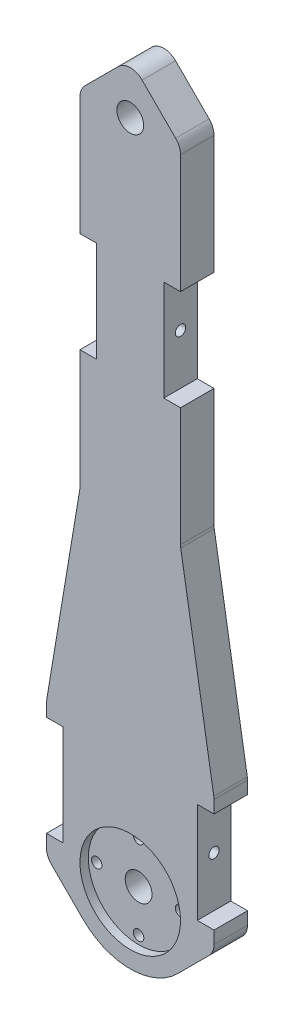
ISO-10303-21;
HEADER;
FILE_DESCRIPTION(('STEP AP214'),'2;1');
FILE_NAME('part.step','',(''),(''),'','','');
FILE_SCHEMA(('AUTOMOTIVE_DESIGN { 1 0 10303 214 1 1 1 1 }'));
ENDSEC;
DATA;
#1=APPLICATION_CONTEXT('core data for automotive mechanical design processes');
#2=APPLICATION_PROTOCOL_DEFINITION('international standard','automotive_design',2000,#1);
#3=PRODUCT_CONTEXT('',#1,'mechanical');
#4=PRODUCT('Part','Part','',(#3));
#5=PRODUCT_RELATED_PRODUCT_CATEGORY('part','',(#4));
#6=PRODUCT_DEFINITION_FORMATION('','',#4);
#7=PRODUCT_DEFINITION_CONTEXT('part definition',#1,'design');
#8=PRODUCT_DEFINITION('design','',#6,#7);
#9=PRODUCT_DEFINITION_SHAPE('','',#8);
#10=(LENGTH_UNIT() NAMED_UNIT(*) SI_UNIT(.MILLI.,.METRE.));
#11=(NAMED_UNIT(*) PLANE_ANGLE_UNIT() SI_UNIT($,.RADIAN.));
#12=(NAMED_UNIT(*) SI_UNIT($,.STERADIAN.) SOLID_ANGLE_UNIT());
#13=UNCERTAINTY_MEASURE_WITH_UNIT(LENGTH_MEASURE(1.E-05),#10,'distance_accuracy_value','');
#14=(GEOMETRIC_REPRESENTATION_CONTEXT(3) GLOBAL_UNCERTAINTY_ASSIGNED_CONTEXT((#13)) GLOBAL_UNIT_ASSIGNED_CONTEXT((#10,
#11,#12)) REPRESENTATION_CONTEXT('',''));
#15=CARTESIAN_POINT('',(0.,0.,0.));
#16=DIRECTION('',(0.,0.,1.));
#17=DIRECTION('',(1.,0.,0.));
#18=AXIS2_PLACEMENT_3D('',#15,#16,#17);
#19=CARTESIAN_POINT('',(0.,12.5,0.));
#20=DIRECTION('',(0.,0.,1.));
#21=DIRECTION('',(1.,0.,0.));
#22=AXIS2_PLACEMENT_3D('',#19,#20,#21);
#23=CYLINDRICAL_SURFACE('',#22,1.55);
#24=CARTESIAN_POINT('',(0.,12.5,3.3));
#25=DIRECTION('',(0.,0.,-1.));
#26=DIRECTION('',(-1.,0.,0.));
#27=AXIS2_PLACEMENT_3D('',#24,#25,#26);
#28=CIRCLE('',#27,1.55);
#29=CARTESIAN_POINT('',(-1.55,12.5,3.3));
#30=VERTEX_POINT('',#29);
#31=EDGE_CURVE('E480',#30,#30,#28,.F.);
#32=ORIENTED_EDGE('',*,*,#31,.F.);
#33=EDGE_LOOP('',(#32));
#34=FACE_BOUND('',#33,.T.);
#35=CARTESIAN_POINT('',(0.,12.5,7.5));
#36=DIRECTION('',(0.,0.,1.));
#37=DIRECTION('',(1.,0.,0.));
#38=AXIS2_PLACEMENT_3D('',#35,#36,#37);
#39=CIRCLE('',#38,1.55);
#40=CARTESIAN_POINT('',(1.55,12.5,7.5));
#41=VERTEX_POINT('',#40);
#42=EDGE_CURVE('E486',#41,#41,#39,.F.);
#43=ORIENTED_EDGE('',*,*,#42,.F.);
#44=EDGE_LOOP('',(#43));
#45=FACE_BOUND('',#44,.T.);
#46=ADVANCED_FACE('F36',(#34,#45),#23,.F.);
#47=CARTESIAN_POINT('',(12.5,0.,0.));
#48=DIRECTION('',(0.,0.,1.));
#49=DIRECTION('',(1.,0.,0.));
#50=AXIS2_PLACEMENT_3D('',#47,#48,#49);
#51=CYLINDRICAL_SURFACE('',#50,1.55);
#52=CARTESIAN_POINT('',(12.5,0.,3.3));
#53=DIRECTION('',(0.,0.,-1.));
#54=DIRECTION('',(-1.,0.,0.));
#55=AXIS2_PLACEMENT_3D('',#52,#53,#54);
#56=CIRCLE('',#55,1.55);
#57=CARTESIAN_POINT('',(10.95,0.,3.3));
#58=VERTEX_POINT('',#57);
#59=EDGE_CURVE('E477',#58,#58,#56,.F.);
#60=ORIENTED_EDGE('',*,*,#59,.F.);
#61=EDGE_LOOP('',(#60));
#62=FACE_BOUND('',#61,.T.);
#63=CARTESIAN_POINT('',(12.5,0.,7.5));
#64=DIRECTION('',(0.,0.,1.));
#65=DIRECTION('',(1.,0.,0.));
#66=AXIS2_PLACEMENT_3D('',#63,#64,#65);
#67=CIRCLE('',#66,1.55);
#68=CARTESIAN_POINT('',(14.05,0.,7.5));
#69=VERTEX_POINT('',#68);
#70=EDGE_CURVE('E493',#69,#69,#67,.F.);
#71=ORIENTED_EDGE('',*,*,#70,.F.);
#72=EDGE_LOOP('',(#71));
#73=FACE_BOUND('',#72,.T.);
#74=ADVANCED_FACE('F632',(#62,#73),#51,.F.);
#75=CARTESIAN_POINT('',(0.,-12.5,0.));
#76=DIRECTION('',(0.,0.,1.));
#77=DIRECTION('',(1.,0.,0.));
#78=AXIS2_PLACEMENT_3D('',#75,#76,#77);
#79=CYLINDRICAL_SURFACE('',#78,1.55);
#80=CARTESIAN_POINT('',(0.,-12.5,3.3));
#81=DIRECTION('',(0.,0.,-1.));
#82=DIRECTION('',(-1.,0.,0.));
#83=AXIS2_PLACEMENT_3D('',#80,#81,#82);
#84=CIRCLE('',#83,1.55);
#85=CARTESIAN_POINT('',(-1.55,-12.5,3.3));
#86=VERTEX_POINT('',#85);
#87=EDGE_CURVE('E473',#86,#86,#84,.F.);
#88=ORIENTED_EDGE('',*,*,#87,.F.);
#89=EDGE_LOOP('',(#88));
#90=FACE_BOUND('',#89,.T.);
#91=CARTESIAN_POINT('',(0.,-12.5,7.5));
#92=DIRECTION('',(0.,0.,1.));
#93=DIRECTION('',(1.,0.,0.));
#94=AXIS2_PLACEMENT_3D('',#91,#92,#93);
#95=CIRCLE('',#94,1.55);
#96=CARTESIAN_POINT('',(1.55,-12.5,7.5));
#97=VERTEX_POINT('',#96);
#98=EDGE_CURVE('E498',#97,#97,#95,.F.);
#99=ORIENTED_EDGE('',*,*,#98,.F.);
#100=EDGE_LOOP('',(#99));
#101=FACE_BOUND('',#100,.T.);
#102=ADVANCED_FACE('F638',(#90,#101),#79,.F.);
#103=CARTESIAN_POINT('',(-12.5,0.,0.));
#104=DIRECTION('',(0.,0.,1.));
#105=DIRECTION('',(1.,0.,0.));
#106=AXIS2_PLACEMENT_3D('',#103,#104,#105);
#107=CYLINDRICAL_SURFACE('',#106,1.55);
#108=CARTESIAN_POINT('',(-12.5,0.,3.3));
#109=DIRECTION('',(0.,0.,-1.));
#110=DIRECTION('',(-1.,0.,0.));
#111=AXIS2_PLACEMENT_3D('',#108,#109,#110);
#112=CIRCLE('',#111,1.55);
#113=CARTESIAN_POINT('',(-14.05,0.,3.3));
#114=VERTEX_POINT('',#113);
#115=EDGE_CURVE('E470',#114,#114,#112,.F.);
#116=ORIENTED_EDGE('',*,*,#115,.F.);
#117=EDGE_LOOP('',(#116));
#118=FACE_BOUND('',#117,.T.);
#119=CARTESIAN_POINT('',(-12.5,0.,7.5));
#120=DIRECTION('',(0.,0.,1.));
#121=DIRECTION('',(1.,0.,0.));
#122=AXIS2_PLACEMENT_3D('',#119,#120,#121);
#123=CIRCLE('',#122,1.55);
#124=CARTESIAN_POINT('',(-10.95,0.,7.5));
#125=VERTEX_POINT('',#124);
#126=EDGE_CURVE('E674',#125,#125,#123,.F.);
#127=ORIENTED_EDGE('',*,*,#126,.F.);
#128=EDGE_LOOP('',(#127));
#129=FACE_BOUND('',#128,.T.);
#130=ADVANCED_FACE('F669',(#118,#129),#107,.F.);
#131=CARTESIAN_POINT('',(0.,0.,0.));
#132=DIRECTION('',(0.,0.,1.));
#133=DIRECTION('',(1.,0.,0.));
#134=AXIS2_PLACEMENT_3D('',#131,#132,#133);
#135=CYLINDRICAL_SURFACE('',#134,4.);
#136=CARTESIAN_POINT('',(0.,0.,0.));
#137=DIRECTION('',(0.,0.,1.));
#138=DIRECTION('',(1.,0.,0.));
#139=AXIS2_PLACEMENT_3D('',#136,#137,#138);
#140=CIRCLE('',#139,4.);
#141=CARTESIAN_POINT('',(4.,0.,0.));
#142=VERTEX_POINT('',#141);
#143=EDGE_CURVE('E482',#142,#142,#140,.T.);
#144=ORIENTED_EDGE('',*,*,#143,.F.);
#145=EDGE_LOOP('',(#144));
#146=FACE_BOUND('',#145,.T.);
#147=CARTESIAN_POINT('',(0.,0.,7.5));
#148=DIRECTION('',(0.,0.,1.));
#149=DIRECTION('',(1.,0.,0.));
#150=AXIS2_PLACEMENT_3D('',#147,#148,#149);
#151=CIRCLE('',#150,4.);
#152=CARTESIAN_POINT('',(4.,0.,7.5));
#153=VERTEX_POINT('',#152);
#154=EDGE_CURVE('E40',#153,#153,#151,.F.);
#155=ORIENTED_EDGE('',*,*,#154,.F.);
#156=EDGE_LOOP('',(#155));
#157=FACE_BOUND('',#156,.T.);
#158=ADVANCED_FACE('F646',(#146,#157),#135,.F.);
#159=CARTESIAN_POINT('',(19.9999999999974,36.3019161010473,10.));
#160=DIRECTION('',(0.,0.,1.));
#161=DIRECTION('',(1.,0.,0.));
#162=AXIS2_PLACEMENT_3D('',#159,#160,#161);
#163=PLANE('',#162);
#164=CARTESIAN_POINT('',(-9.2241647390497E-13,200.,10.));
#165=DIRECTION('',(0.,0.,1.));
#166=DIRECTION('',(1.,0.,0.));
#167=AXIS2_PLACEMENT_3D('',#164,#165,#166);
#168=CIRCLE('',#167,4.00000000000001);
#169=CARTESIAN_POINT('',(3.99999999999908,200.,10.));
#170=VERTEX_POINT('',#169);
#171=EDGE_CURVE('E507',#170,#170,#168,.T.);
#172=ORIENTED_EDGE('',*,*,#171,.F.);
#173=EDGE_LOOP('',(#172));
#174=FACE_BOUND('',#173,.T.);
#175=CARTESIAN_POINT('',(0.,0.,10.));
#176=DIRECTION('',(0.,0.,-1.));
#177=DIRECTION('',(1.,0.,0.));
#178=AXIS2_PLACEMENT_3D('',#175,#176,#177);
#179=CIRCLE('',#178,15.);
#180=CARTESIAN_POINT('',(15.,0.,10.));
#181=VERTEX_POINT('',#180);
#182=EDGE_CURVE('E307',#181,#181,#179,.T.);
#183=ORIENTED_EDGE('',*,*,#182,.T.);
#184=EDGE_LOOP('',(#183));
#185=FACE_BOUND('',#184,.T.);
#186=DIRECTION('',(0.,1.,0.));
#187=VECTOR('',#186,1.);
#188=CARTESIAN_POINT('',(19.9999999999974,2.54435633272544,10.));
#189=LINE('',#188,#187);
#190=CARTESIAN_POINT('',(19.9999999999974,2.54435633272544,10.));
#191=VERTEX_POINT('',#190);
#192=CARTESIAN_POINT('',(19.9999999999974,32.5443563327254,10.));
#193=VERTEX_POINT('',#192);
#194=EDGE_CURVE('E374',#191,#193,#189,.T.);
#195=ORIENTED_EDGE('',*,*,#194,.T.);
#196=DIRECTION('',(1.,0.,0.));
#197=VECTOR('',#196,1.);
#198=CARTESIAN_POINT('',(19.9999999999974,32.5443563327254,10.));
#199=LINE('',#198,#197);
#200=CARTESIAN_POINT('',(24.9999999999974,32.5443563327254,10.));
#201=VERTEX_POINT('',#200);
#202=EDGE_CURVE('E182',#193,#201,#199,.T.);
#203=ORIENTED_EDGE('',*,*,#202,.T.);
#204=DIRECTION('',(0.,1.,0.));
#205=VECTOR('',#204,1.);
#206=CARTESIAN_POINT('',(24.9999999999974,32.5443563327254,10.));
#207=LINE('',#206,#205);
#208=CARTESIAN_POINT('',(24.9999999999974,36.3019161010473,10.));
#209=VERTEX_POINT('',#208);
#210=EDGE_CURVE('E542',#201,#209,#207,.T.);
#211=ORIENTED_EDGE('',*,*,#210,.T.);
#212=CARTESIAN_POINT('',(19.9999999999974,36.3019161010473,10.));
#213=DIRECTION('',(0.,0.,1.));
#214=DIRECTION('',(1.,0.,0.));
#215=AXIS2_PLACEMENT_3D('',#212,#213,#214);
#216=CIRCLE('',#215,5.);
#217=CARTESIAN_POINT('',(24.9319696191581,37.1239110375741,10.));
#218=VERTEX_POINT('',#217);
#219=EDGE_CURVE('E544',#209,#218,#216,.T.);
#220=ORIENTED_EDGE('',*,*,#219,.T.);
#221=DIRECTION('',(-0.164398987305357,0.986393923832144,0.));
#222=VECTOR('',#221,1.);
#223=CARTESIAN_POINT('',(24.9319696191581,37.1239110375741,10.));
#224=LINE('',#223,#222);
#225=CARTESIAN_POINT('',(15.0680303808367,96.3075464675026,10.));
#226=VERTEX_POINT('',#225);
#227=EDGE_CURVE('E546',#218,#226,#224,.T.);
#228=ORIENTED_EDGE('',*,*,#227,.T.);
#229=CARTESIAN_POINT('',(19.9999999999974,97.1295414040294,10.));
#230=DIRECTION('',(0.,0.,-1.));
#231=DIRECTION('',(1.,0.,0.));
#232=AXIS2_PLACEMENT_3D('',#229,#230,#231);
#233=CIRCLE('',#232,5.);
#234=CARTESIAN_POINT('',(14.9999999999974,97.1295414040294,10.));
#235=VERTEX_POINT('',#234);
#236=EDGE_CURVE('E548',#226,#235,#233,.T.);
#237=ORIENTED_EDGE('',*,*,#236,.T.);
#238=DIRECTION('',(0.,1.,0.));
#239=VECTOR('',#238,1.);
#240=CARTESIAN_POINT('',(14.9999999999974,97.1295414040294,10.));
#241=LINE('',#240,#239);
#242=CARTESIAN_POINT('',(14.9999999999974,132.529236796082,10.));
#243=VERTEX_POINT('',#242);
#244=EDGE_CURVE('E550',#235,#243,#241,.T.);
#245=ORIENTED_EDGE('',*,*,#244,.T.);
#246=DIRECTION('',(-1.,0.,0.));
#247=VECTOR('',#246,1.);
#248=CARTESIAN_POINT('',(14.9999999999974,132.529236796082,10.));
#249=LINE('',#248,#247);
#250=CARTESIAN_POINT('',(9.99999999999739,132.529236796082,10.));
#251=VERTEX_POINT('',#250);
#252=EDGE_CURVE('E552',#243,#251,#249,.T.);
#253=ORIENTED_EDGE('',*,*,#252,.T.);
#254=DIRECTION('',(0.,1.,0.));
#255=VECTOR('',#254,1.);
#256=CARTESIAN_POINT('',(9.99999999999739,132.529236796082,10.));
#257=LINE('',#256,#255);
#258=CARTESIAN_POINT('',(9.99999999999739,162.529236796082,10.));
#259=VERTEX_POINT('',#258);
#260=EDGE_CURVE('E554',#251,#259,#257,.T.);
#261=ORIENTED_EDGE('',*,*,#260,.T.);
#262=DIRECTION('',(1.,0.,0.));
#263=VECTOR('',#262,1.);
#264=CARTESIAN_POINT('',(9.99999999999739,162.529236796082,10.));
#265=LINE('',#264,#263);
#266=CARTESIAN_POINT('',(14.9999999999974,162.529236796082,10.));
#267=VERTEX_POINT('',#266);
#268=EDGE_CURVE('E556',#259,#267,#265,.T.);
#269=ORIENTED_EDGE('',*,*,#268,.T.);
#270=DIRECTION('',(0.,1.,0.));
#271=VECTOR('',#270,1.);
#272=CARTESIAN_POINT('',(14.9999999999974,162.529236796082,10.));
#273=LINE('',#272,#271);
#274=CARTESIAN_POINT('',(14.9999999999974,197.928932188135,10.));
#275=VERTEX_POINT('',#274);
#276=EDGE_CURVE('E558',#267,#275,#273,.T.);
#277=ORIENTED_EDGE('',*,*,#276,.T.);
#278=CARTESIAN_POINT('',(9.99999999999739,197.928932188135,10.));
#279=DIRECTION('',(0.,0.,1.));
#280=DIRECTION('',(1.,0.,0.));
#281=AXIS2_PLACEMENT_3D('',#278,#279,#280);
#282=CIRCLE('',#281,5.);
#283=CARTESIAN_POINT('',(13.5355339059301,201.464466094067,10.));
#284=VERTEX_POINT('',#283);
#285=EDGE_CURVE('E560',#275,#284,#282,.T.);
#286=ORIENTED_EDGE('',*,*,#285,.T.);
#287=DIRECTION('',(-0.707106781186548,0.707106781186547,0.));
#288=VECTOR('',#287,1.);
#289=CARTESIAN_POINT('',(13.5355339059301,201.464466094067,10.));
#290=LINE('',#289,#288);
#291=CARTESIAN_POINT('',(3.53553390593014,211.464466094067,10.));
#292=VERTEX_POINT('',#291);
#293=EDGE_CURVE('E562',#284,#292,#290,.T.);
#294=ORIENTED_EDGE('',*,*,#293,.T.);
#295=CARTESIAN_POINT('',(-2.59712072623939E-12,207.928932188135,10.));
#296=DIRECTION('',(0.,0.,1.));
#297=DIRECTION('',(1.,0.,0.));
#298=AXIS2_PLACEMENT_3D('',#295,#296,#297);
#299=CIRCLE('',#298,5.);
#300=CARTESIAN_POINT('',(-3.53553390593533,211.464466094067,10.));
#301=VERTEX_POINT('',#300);
#302=EDGE_CURVE('E564',#292,#301,#299,.T.);
#303=ORIENTED_EDGE('',*,*,#302,.T.);
#304=DIRECTION('',(-0.707106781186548,-0.707106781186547,0.));
#305=VECTOR('',#304,1.);
#306=CARTESIAN_POINT('',(-3.53553390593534,211.464466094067,10.));
#307=LINE('',#306,#305);
#308=CARTESIAN_POINT('',(-13.5355339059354,201.464466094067,10.));
#309=VERTEX_POINT('',#308);
#310=EDGE_CURVE('E566',#301,#309,#307,.T.);
#311=ORIENTED_EDGE('',*,*,#310,.T.);
#312=CARTESIAN_POINT('',(-10.0000000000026,197.928932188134,10.));
#313=DIRECTION('',(0.,0.,1.));
#314=DIRECTION('',(1.,0.,0.));
#315=AXIS2_PLACEMENT_3D('',#312,#313,#314);
#316=CIRCLE('',#315,5.00000000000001);
#317=CARTESIAN_POINT('',(-15.0000000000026,197.928932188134,10.));
#318=VERTEX_POINT('',#317);
#319=EDGE_CURVE('E568',#309,#318,#316,.T.);
#320=ORIENTED_EDGE('',*,*,#319,.T.);
#321=DIRECTION('',(0.,-1.,0.));
#322=VECTOR('',#321,1.);
#323=CARTESIAN_POINT('',(-15.0000000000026,197.928932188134,10.));
#324=LINE('',#323,#322);
#325=CARTESIAN_POINT('',(-15.0000000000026,162.529236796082,10.));
#326=VERTEX_POINT('',#325);
#327=EDGE_CURVE('E570',#318,#326,#324,.T.);
#328=ORIENTED_EDGE('',*,*,#327,.T.);
#329=DIRECTION('',(1.,0.,0.));
#330=VECTOR('',#329,1.);
#331=CARTESIAN_POINT('',(-15.0000000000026,162.529236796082,10.));
#332=LINE('',#331,#330);
#333=CARTESIAN_POINT('',(-10.0000000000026,162.529236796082,10.));
#334=VERTEX_POINT('',#333);
#335=EDGE_CURVE('E572',#326,#334,#332,.T.);
#336=ORIENTED_EDGE('',*,*,#335,.T.);
#337=DIRECTION('',(0.,-1.,0.));
#338=VECTOR('',#337,1.);
#339=CARTESIAN_POINT('',(-10.0000000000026,162.529236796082,10.));
#340=LINE('',#339,#338);
#341=CARTESIAN_POINT('',(-10.0000000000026,132.529236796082,10.));
#342=VERTEX_POINT('',#341);
#343=EDGE_CURVE('E574',#334,#342,#340,.T.);
#344=ORIENTED_EDGE('',*,*,#343,.T.);
#345=DIRECTION('',(-1.,0.,0.));
#346=VECTOR('',#345,1.);
#347=CARTESIAN_POINT('',(-10.0000000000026,132.529236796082,10.));
#348=LINE('',#347,#346);
#349=CARTESIAN_POINT('',(-15.0000000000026,132.529236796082,10.));
#350=VERTEX_POINT('',#349);
#351=EDGE_CURVE('E576',#342,#350,#348,.T.);
#352=ORIENTED_EDGE('',*,*,#351,.T.);
#353=DIRECTION('',(0.,-1.,0.));
#354=VECTOR('',#353,1.);
#355=CARTESIAN_POINT('',(-15.0000000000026,132.529236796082,10.));
#356=LINE('',#355,#354);
#357=CARTESIAN_POINT('',(-15.0000000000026,97.1295414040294,10.));
#358=VERTEX_POINT('',#357);
#359=EDGE_CURVE('E578',#350,#358,#356,.T.);
#360=ORIENTED_EDGE('',*,*,#359,.T.);
#361=CARTESIAN_POINT('',(-20.0000000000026,97.1295414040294,10.));
#362=DIRECTION('',(0.,0.,-1.));
#363=DIRECTION('',(1.,0.,0.));
#364=AXIS2_PLACEMENT_3D('',#361,#362,#363);
#365=CIRCLE('',#364,5.);
#366=CARTESIAN_POINT('',(-15.0680303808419,96.3075464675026,10.));
#367=VERTEX_POINT('',#366);
#368=EDGE_CURVE('E580',#358,#367,#365,.T.);
#369=ORIENTED_EDGE('',*,*,#368,.T.);
#370=DIRECTION('',(-0.164398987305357,-0.986393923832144,0.));
#371=VECTOR('',#370,1.);
#372=CARTESIAN_POINT('',(-15.0680303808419,96.3075464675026,10.));
#373=LINE('',#372,#371);
#374=CARTESIAN_POINT('',(-24.9319696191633,37.1239110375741,10.));
#375=VERTEX_POINT('',#374);
#376=EDGE_CURVE('E582',#367,#375,#373,.T.);
#377=ORIENTED_EDGE('',*,*,#376,.T.);
#378=CARTESIAN_POINT('',(-20.0000000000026,36.3019161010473,10.));
#379=DIRECTION('',(0.,0.,1.));
#380=DIRECTION('',(1.,0.,0.));
#381=AXIS2_PLACEMENT_3D('',#378,#379,#380);
#382=CIRCLE('',#381,5.);
#383=CARTESIAN_POINT('',(-25.0000000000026,36.3019161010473,10.));
#384=VERTEX_POINT('',#383);
#385=EDGE_CURVE('E584',#375,#384,#382,.T.);
#386=ORIENTED_EDGE('',*,*,#385,.T.);
#387=DIRECTION('',(0.,-1.,0.));
#388=VECTOR('',#387,1.);
#389=CARTESIAN_POINT('',(-25.0000000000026,36.3019161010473,10.));
#390=LINE('',#389,#388);
#391=CARTESIAN_POINT('',(-25.0000000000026,32.5443563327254,10.));
#392=VERTEX_POINT('',#391);
#393=EDGE_CURVE('E586',#384,#392,#390,.T.);
#394=ORIENTED_EDGE('',*,*,#393,.T.);
#395=DIRECTION('',(1.,0.,0.));
#396=VECTOR('',#395,1.);
#397=CARTESIAN_POINT('',(-25.0000000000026,32.5443563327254,10.));
#398=LINE('',#397,#396);
#399=CARTESIAN_POINT('',(-20.0000000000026,32.5443563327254,10.));
#400=VERTEX_POINT('',#399);
#401=EDGE_CURVE('E588',#392,#400,#398,.T.);
#402=ORIENTED_EDGE('',*,*,#401,.T.);
#403=DIRECTION('',(0.,-1.,0.));
#404=VECTOR('',#403,1.);
#405=CARTESIAN_POINT('',(-20.0000000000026,32.5443563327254,10.));
#406=LINE('',#405,#404);
#407=CARTESIAN_POINT('',(-20.0000000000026,2.54435633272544,10.));
#408=VERTEX_POINT('',#407);
#409=EDGE_CURVE('E590',#400,#408,#406,.T.);
#410=ORIENTED_EDGE('',*,*,#409,.T.);
#411=DIRECTION('',(-1.,0.,0.));
#412=VECTOR('',#411,1.);
#413=CARTESIAN_POINT('',(-20.0000000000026,2.54435633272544,10.));
#414=LINE('',#413,#412);
#415=CARTESIAN_POINT('',(-25.0000000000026,2.54435633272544,10.));
#416=VERTEX_POINT('',#415);
#417=EDGE_CURVE('E592',#408,#416,#414,.T.);
#418=ORIENTED_EDGE('',*,*,#417,.T.);
#419=DIRECTION('',(0.,-1.,0.));
#420=VECTOR('',#419,1.);
#421=CARTESIAN_POINT('',(-25.0000000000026,2.54435633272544,10.));
#422=LINE('',#421,#420);
#423=CARTESIAN_POINT('',(-25.0000000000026,-1.21320343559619,10.));
#424=VERTEX_POINT('',#423);
#425=EDGE_CURVE('E594',#416,#424,#422,.T.);
#426=ORIENTED_EDGE('',*,*,#425,.T.);
#427=CARTESIAN_POINT('',(-20.0000000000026,-1.21320343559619,10.));
#428=DIRECTION('',(0.,0.,1.));
#429=DIRECTION('',(1.,0.,0.));
#430=AXIS2_PLACEMENT_3D('',#427,#428,#429);
#431=CIRCLE('',#430,5.);
#432=CARTESIAN_POINT('',(-23.5355339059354,-4.74873734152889,10.));
#433=VERTEX_POINT('',#432);
#434=EDGE_CURVE('E596',#424,#433,#431,.T.);
#435=ORIENTED_EDGE('',*,*,#434,.T.);
#436=DIRECTION('',(0.707106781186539,-0.707106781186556,0.));
#437=VECTOR('',#436,1.);
#438=CARTESIAN_POINT('',(-23.5355339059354,-4.74873734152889,10.));
#439=LINE('',#438,#437);
#440=CARTESIAN_POINT('',(-14.1421356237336,-14.1421356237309,10.));
#441=VERTEX_POINT('',#440);
#442=EDGE_CURVE('E598',#433,#441,#439,.T.);
#443=ORIENTED_EDGE('',*,*,#442,.T.);
#444=CARTESIAN_POINT('',(-2.60926379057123E-12,0.,10.));
#445=DIRECTION('',(0.,0.,1.));
#446=DIRECTION('',(1.,0.,0.));
#447=AXIS2_PLACEMENT_3D('',#444,#445,#446);
#448=CIRCLE('',#447,20.);
#449=CARTESIAN_POINT('',(14.1421356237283,-14.1421356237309,10.));
#450=VERTEX_POINT('',#449);
#451=EDGE_CURVE('E600',#441,#450,#448,.T.);
#452=ORIENTED_EDGE('',*,*,#451,.T.);
#453=DIRECTION('',(0.707106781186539,0.707106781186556,0.));
#454=VECTOR('',#453,1.);
#455=CARTESIAN_POINT('',(14.1421356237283,-14.1421356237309,10.));
#456=LINE('',#455,#454);
#457=CARTESIAN_POINT('',(23.5355339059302,-4.74873734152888,10.));
#458=VERTEX_POINT('',#457);
#459=EDGE_CURVE('E285',#450,#458,#456,.T.);
#460=ORIENTED_EDGE('',*,*,#459,.T.);
#461=CARTESIAN_POINT('',(19.9999999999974,-1.21320343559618,10.));
#462=DIRECTION('',(0.,0.,1.));
#463=DIRECTION('',(1.,0.,0.));
#464=AXIS2_PLACEMENT_3D('',#461,#462,#463);
#465=CIRCLE('',#464,5.);
#466=CARTESIAN_POINT('',(24.9999999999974,-1.21320343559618,10.));
#467=VERTEX_POINT('',#466);
#468=EDGE_CURVE('E279',#458,#467,#465,.T.);
#469=ORIENTED_EDGE('',*,*,#468,.T.);
#470=DIRECTION('',(0.,1.,0.));
#471=VECTOR('',#470,1.);
#472=CARTESIAN_POINT('',(24.9999999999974,-1.21320343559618,10.));
#473=LINE('',#472,#471);
#474=CARTESIAN_POINT('',(24.9999999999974,2.54435633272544,10.));
#475=VERTEX_POINT('',#474);
#476=EDGE_CURVE('E283',#467,#475,#473,.T.);
#477=ORIENTED_EDGE('',*,*,#476,.T.);
#478=DIRECTION('',(-1.,0.,0.));
#479=VECTOR('',#478,1.);
#480=CARTESIAN_POINT('',(24.9999999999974,2.54435633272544,10.));
#481=LINE('',#480,#479);
#482=EDGE_CURVE('E55',#475,#191,#481,.T.);
#483=ORIENTED_EDGE('',*,*,#482,.T.);
#484=EDGE_LOOP('',(#195,#203,#211,#220,#228,#237,#245,#253,#261,#269,#277,#286,#294,#303,#311,
#320,#328,#336,#344,#352,#360,#369,#377,#386,#394,#402,#410,#418,#426,#435,#443,#452,#460,#469,
#477,#483));
#485=FACE_BOUND('',#484,.T.);
#486=ADVANCED_FACE('F281',(#174,#185,#485),#163,.T.);
#487=CARTESIAN_POINT('',(19.9999999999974,36.3019161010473,0.));
#488=DIRECTION('',(0.,0.,1.));
#489=DIRECTION('',(1.,0.,0.));
#490=AXIS2_PLACEMENT_3D('',#487,#488,#489);
#491=PLANE('',#490);
#492=CARTESIAN_POINT('',(-9.2241647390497E-13,200.,0.));
#493=DIRECTION('',(0.,0.,1.));
#494=DIRECTION('',(1.,0.,0.));
#495=AXIS2_PLACEMENT_3D('',#492,#493,#494);
#496=CIRCLE('',#495,4.00000000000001);
#497=CARTESIAN_POINT('',(3.99999999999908,200.,0.));
#498=VERTEX_POINT('',#497);
#499=EDGE_CURVE('E508',#498,#498,#496,.T.);
#500=ORIENTED_EDGE('',*,*,#499,.T.);
#501=EDGE_LOOP('',(#500));
#502=FACE_BOUND('',#501,.T.);
#503=CARTESIAN_POINT('',(-12.5,0.,0.));
#504=DIRECTION('',(0.,0.,-1.));
#505=DIRECTION('',(-1.,0.,0.));
#506=AXIS2_PLACEMENT_3D('',#503,#504,#505);
#507=CIRCLE('',#506,2.875);
#508=CARTESIAN_POINT('',(-15.375,0.,0.));
#509=VERTEX_POINT('',#508);
#510=EDGE_CURVE('E516',#509,#509,#507,.T.);
#511=ORIENTED_EDGE('',*,*,#510,.F.);
#512=EDGE_LOOP('',(#511));
#513=FACE_BOUND('',#512,.T.);
#514=CARTESIAN_POINT('',(0.,-12.5,0.));
#515=DIRECTION('',(0.,0.,-1.));
#516=DIRECTION('',(-1.,0.,0.));
#517=AXIS2_PLACEMENT_3D('',#514,#515,#516);
#518=CIRCLE('',#517,2.875);
#519=CARTESIAN_POINT('',(-2.875,-12.5,0.));
#520=VERTEX_POINT('',#519);
#521=EDGE_CURVE('E519',#520,#520,#518,.T.);
#522=ORIENTED_EDGE('',*,*,#521,.F.);
#523=EDGE_LOOP('',(#522));
#524=FACE_BOUND('',#523,.T.);
#525=CARTESIAN_POINT('',(0.,12.5,0.));
#526=DIRECTION('',(0.,0.,-1.));
#527=DIRECTION('',(-1.,0.,0.));
#528=AXIS2_PLACEMENT_3D('',#525,#526,#527);
#529=CIRCLE('',#528,2.875);
#530=CARTESIAN_POINT('',(-2.875,12.5,0.));
#531=VERTEX_POINT('',#530);
#532=EDGE_CURVE('E525',#531,#531,#529,.T.);
#533=ORIENTED_EDGE('',*,*,#532,.F.);
#534=EDGE_LOOP('',(#533));
#535=FACE_BOUND('',#534,.T.);
#536=CARTESIAN_POINT('',(12.5,0.,0.));
#537=DIRECTION('',(0.,0.,-1.));
#538=DIRECTION('',(-1.,0.,0.));
#539=AXIS2_PLACEMENT_3D('',#536,#537,#538);
#540=CIRCLE('',#539,2.875);
#541=CARTESIAN_POINT('',(9.625,0.,0.));
#542=VERTEX_POINT('',#541);
#543=EDGE_CURVE('E531',#542,#542,#540,.T.);
#544=ORIENTED_EDGE('',*,*,#543,.F.);
#545=EDGE_LOOP('',(#544));
#546=FACE_BOUND('',#545,.T.);
#547=ORIENTED_EDGE('',*,*,#143,.T.);
#548=EDGE_LOOP('',(#547));
#549=FACE_BOUND('',#548,.T.);
#550=DIRECTION('',(0.,1.,0.));
#551=VECTOR('',#550,1.);
#552=CARTESIAN_POINT('',(19.9999999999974,2.54435633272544,0.));
#553=LINE('',#552,#551);
#554=CARTESIAN_POINT('',(19.9999999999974,2.54435633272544,0.));
#555=VERTEX_POINT('',#554);
#556=CARTESIAN_POINT('',(19.9999999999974,32.5443563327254,0.));
#557=VERTEX_POINT('',#556);
#558=EDGE_CURVE('E303',#555,#557,#553,.T.);
#559=ORIENTED_EDGE('',*,*,#558,.F.);
#560=DIRECTION('',(-1.,0.,0.));
#561=VECTOR('',#560,1.);
#562=CARTESIAN_POINT('',(24.9999999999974,2.54435633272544,0.));
#563=LINE('',#562,#561);
#564=CARTESIAN_POINT('',(24.9999999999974,2.54435633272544,0.));
#565=VERTEX_POINT('',#564);
#566=EDGE_CURVE('E174',#565,#555,#563,.T.);
#567=ORIENTED_EDGE('',*,*,#566,.F.);
#568=DIRECTION('',(0.,1.,0.));
#569=VECTOR('',#568,1.);
#570=CARTESIAN_POINT('',(24.9999999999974,-1.21320343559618,0.));
#571=LINE('',#570,#569);
#572=CARTESIAN_POINT('',(24.9999999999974,-1.21320343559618,0.));
#573=VERTEX_POINT('',#572);
#574=EDGE_CURVE('E168',#573,#565,#571,.T.);
#575=ORIENTED_EDGE('',*,*,#574,.F.);
#576=CARTESIAN_POINT('',(19.9999999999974,-1.21320343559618,0.));
#577=DIRECTION('',(0.,0.,1.));
#578=DIRECTION('',(1.,0.,0.));
#579=AXIS2_PLACEMENT_3D('',#576,#577,#578);
#580=CIRCLE('',#579,5.);
#581=CARTESIAN_POINT('',(23.5355339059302,-4.74873734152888,0.));
#582=VERTEX_POINT('',#581);
#583=EDGE_CURVE('E293',#582,#573,#580,.T.);
#584=ORIENTED_EDGE('',*,*,#583,.F.);
#585=DIRECTION('',(0.707106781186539,0.707106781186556,0.));
#586=VECTOR('',#585,1.);
#587=CARTESIAN_POINT('',(14.1421356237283,-14.1421356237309,0.));
#588=LINE('',#587,#586);
#589=CARTESIAN_POINT('',(14.1421356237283,-14.1421356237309,0.));
#590=VERTEX_POINT('',#589);
#591=EDGE_CURVE('E369',#590,#582,#588,.T.);
#592=ORIENTED_EDGE('',*,*,#591,.F.);
#593=CARTESIAN_POINT('',(-2.60926379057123E-12,0.,0.));
#594=DIRECTION('',(0.,0.,1.));
#595=DIRECTION('',(1.,0.,0.));
#596=AXIS2_PLACEMENT_3D('',#593,#594,#595);
#597=CIRCLE('',#596,20.);
#598=CARTESIAN_POINT('',(-14.1421356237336,-14.1421356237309,0.));
#599=VERTEX_POINT('',#598);
#600=EDGE_CURVE('E367',#599,#590,#597,.T.);
#601=ORIENTED_EDGE('',*,*,#600,.F.);
#602=DIRECTION('',(0.707106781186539,-0.707106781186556,0.));
#603=VECTOR('',#602,1.);
#604=CARTESIAN_POINT('',(-23.5355339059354,-4.74873734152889,0.));
#605=LINE('',#604,#603);
#606=CARTESIAN_POINT('',(-23.5355339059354,-4.74873734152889,0.));
#607=VERTEX_POINT('',#606);
#608=EDGE_CURVE('E365',#607,#599,#605,.T.);
#609=ORIENTED_EDGE('',*,*,#608,.F.);
#610=CARTESIAN_POINT('',(-20.0000000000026,-1.21320343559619,0.));
#611=DIRECTION('',(0.,0.,1.));
#612=DIRECTION('',(1.,0.,0.));
#613=AXIS2_PLACEMENT_3D('',#610,#611,#612);
#614=CIRCLE('',#613,5.);
#615=CARTESIAN_POINT('',(-25.0000000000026,-1.21320343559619,0.));
#616=VERTEX_POINT('',#615);
#617=EDGE_CURVE('E363',#616,#607,#614,.T.);
#618=ORIENTED_EDGE('',*,*,#617,.F.);
#619=DIRECTION('',(0.,-1.,0.));
#620=VECTOR('',#619,1.);
#621=CARTESIAN_POINT('',(-25.0000000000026,2.54435633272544,0.));
#622=LINE('',#621,#620);
#623=CARTESIAN_POINT('',(-25.0000000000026,2.54435633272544,0.));
#624=VERTEX_POINT('',#623);
#625=EDGE_CURVE('E361',#624,#616,#622,.T.);
#626=ORIENTED_EDGE('',*,*,#625,.F.);
#627=DIRECTION('',(-1.,0.,0.));
#628=VECTOR('',#627,1.);
#629=CARTESIAN_POINT('',(-20.0000000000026,2.54435633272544,0.));
#630=LINE('',#629,#628);
#631=CARTESIAN_POINT('',(-20.0000000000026,2.54435633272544,0.));
#632=VERTEX_POINT('',#631);
#633=EDGE_CURVE('E359',#632,#624,#630,.T.);
#634=ORIENTED_EDGE('',*,*,#633,.F.);
#635=DIRECTION('',(0.,-1.,0.));
#636=VECTOR('',#635,1.);
#637=CARTESIAN_POINT('',(-20.0000000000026,32.5443563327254,0.));
#638=LINE('',#637,#636);
#639=CARTESIAN_POINT('',(-20.0000000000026,32.5443563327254,0.));
#640=VERTEX_POINT('',#639);
#641=EDGE_CURVE('E357',#640,#632,#638,.T.);
#642=ORIENTED_EDGE('',*,*,#641,.F.);
#643=DIRECTION('',(1.,0.,0.));
#644=VECTOR('',#643,1.);
#645=CARTESIAN_POINT('',(-25.0000000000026,32.5443563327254,0.));
#646=LINE('',#645,#644);
#647=CARTESIAN_POINT('',(-25.0000000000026,32.5443563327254,0.));
#648=VERTEX_POINT('',#647);
#649=EDGE_CURVE('E355',#648,#640,#646,.T.);
#650=ORIENTED_EDGE('',*,*,#649,.F.);
#651=DIRECTION('',(0.,-1.,0.));
#652=VECTOR('',#651,1.);
#653=CARTESIAN_POINT('',(-25.0000000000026,36.3019161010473,0.));
#654=LINE('',#653,#652);
#655=CARTESIAN_POINT('',(-25.0000000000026,36.3019161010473,0.));
#656=VERTEX_POINT('',#655);
#657=EDGE_CURVE('E353',#656,#648,#654,.T.);
#658=ORIENTED_EDGE('',*,*,#657,.F.);
#659=CARTESIAN_POINT('',(-20.0000000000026,36.3019161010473,0.));
#660=DIRECTION('',(0.,0.,1.));
#661=DIRECTION('',(1.,0.,0.));
#662=AXIS2_PLACEMENT_3D('',#659,#660,#661);
#663=CIRCLE('',#662,5.);
#664=CARTESIAN_POINT('',(-24.9319696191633,37.1239110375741,0.));
#665=VERTEX_POINT('',#664);
#666=EDGE_CURVE('E351',#665,#656,#663,.T.);
#667=ORIENTED_EDGE('',*,*,#666,.F.);
#668=DIRECTION('',(-0.164398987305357,-0.986393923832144,0.));
#669=VECTOR('',#668,1.);
#670=CARTESIAN_POINT('',(-15.0680303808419,96.3075464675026,0.));
#671=LINE('',#670,#669);
#672=CARTESIAN_POINT('',(-15.0680303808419,96.3075464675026,0.));
#673=VERTEX_POINT('',#672);
#674=EDGE_CURVE('E349',#673,#665,#671,.T.);
#675=ORIENTED_EDGE('',*,*,#674,.F.);
#676=CARTESIAN_POINT('',(-20.0000000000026,97.1295414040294,0.));
#677=DIRECTION('',(0.,0.,-1.));
#678=DIRECTION('',(1.,0.,0.));
#679=AXIS2_PLACEMENT_3D('',#676,#677,#678);
#680=CIRCLE('',#679,5.);
#681=CARTESIAN_POINT('',(-15.0000000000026,97.1295414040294,0.));
#682=VERTEX_POINT('',#681);
#683=EDGE_CURVE('E347',#682,#673,#680,.T.);
#684=ORIENTED_EDGE('',*,*,#683,.F.);
#685=DIRECTION('',(0.,-1.,0.));
#686=VECTOR('',#685,1.);
#687=CARTESIAN_POINT('',(-15.0000000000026,132.529236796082,0.));
#688=LINE('',#687,#686);
#689=CARTESIAN_POINT('',(-15.0000000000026,132.529236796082,0.));
#690=VERTEX_POINT('',#689);
#691=EDGE_CURVE('E345',#690,#682,#688,.T.);
#692=ORIENTED_EDGE('',*,*,#691,.F.);
#693=DIRECTION('',(-1.,0.,0.));
#694=VECTOR('',#693,1.);
#695=CARTESIAN_POINT('',(-10.0000000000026,132.529236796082,0.));
#696=LINE('',#695,#694);
#697=CARTESIAN_POINT('',(-10.0000000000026,132.529236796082,0.));
#698=VERTEX_POINT('',#697);
#699=EDGE_CURVE('E343',#698,#690,#696,.T.);
#700=ORIENTED_EDGE('',*,*,#699,.F.);
#701=DIRECTION('',(0.,-1.,0.));
#702=VECTOR('',#701,1.);
#703=CARTESIAN_POINT('',(-10.0000000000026,162.529236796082,0.));
#704=LINE('',#703,#702);
#705=CARTESIAN_POINT('',(-10.0000000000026,162.529236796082,0.));
#706=VERTEX_POINT('',#705);
#707=EDGE_CURVE('E341',#706,#698,#704,.T.);
#708=ORIENTED_EDGE('',*,*,#707,.F.);
#709=DIRECTION('',(1.,0.,0.));
#710=VECTOR('',#709,1.);
#711=CARTESIAN_POINT('',(-15.0000000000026,162.529236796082,0.));
#712=LINE('',#711,#710);
#713=CARTESIAN_POINT('',(-15.0000000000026,162.529236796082,0.));
#714=VERTEX_POINT('',#713);
#715=EDGE_CURVE('E339',#714,#706,#712,.T.);
#716=ORIENTED_EDGE('',*,*,#715,.F.);
#717=DIRECTION('',(0.,-1.,0.));
#718=VECTOR('',#717,1.);
#719=CARTESIAN_POINT('',(-15.0000000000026,197.928932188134,0.));
#720=LINE('',#719,#718);
#721=CARTESIAN_POINT('',(-15.0000000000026,197.928932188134,0.));
#722=VERTEX_POINT('',#721);
#723=EDGE_CURVE('E337',#722,#714,#720,.T.);
#724=ORIENTED_EDGE('',*,*,#723,.F.);
#725=CARTESIAN_POINT('',(-10.0000000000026,197.928932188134,0.));
#726=DIRECTION('',(0.,0.,1.));
#727=DIRECTION('',(1.,0.,0.));
#728=AXIS2_PLACEMENT_3D('',#725,#726,#727);
#729=CIRCLE('',#728,5.00000000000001);
#730=CARTESIAN_POINT('',(-13.5355339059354,201.464466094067,0.));
#731=VERTEX_POINT('',#730);
#732=EDGE_CURVE('E335',#731,#722,#729,.T.);
#733=ORIENTED_EDGE('',*,*,#732,.F.);
#734=DIRECTION('',(-0.707106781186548,-0.707106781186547,0.));
#735=VECTOR('',#734,1.);
#736=CARTESIAN_POINT('',(-3.53553390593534,211.464466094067,0.));
#737=LINE('',#736,#735);
#738=CARTESIAN_POINT('',(-3.53553390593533,211.464466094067,0.));
#739=VERTEX_POINT('',#738);
#740=EDGE_CURVE('E333',#739,#731,#737,.T.);
#741=ORIENTED_EDGE('',*,*,#740,.F.);
#742=CARTESIAN_POINT('',(-2.59712072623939E-12,207.928932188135,0.));
#743=DIRECTION('',(0.,0.,1.));
#744=DIRECTION('',(1.,0.,0.));
#745=AXIS2_PLACEMENT_3D('',#742,#743,#744);
#746=CIRCLE('',#745,5.);
#747=CARTESIAN_POINT('',(3.53553390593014,211.464466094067,0.));
#748=VERTEX_POINT('',#747);
#749=EDGE_CURVE('E331',#748,#739,#746,.T.);
#750=ORIENTED_EDGE('',*,*,#749,.F.);
#751=DIRECTION('',(-0.707106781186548,0.707106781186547,0.));
#752=VECTOR('',#751,1.);
#753=CARTESIAN_POINT('',(13.5355339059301,201.464466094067,0.));
#754=LINE('',#753,#752);
#755=CARTESIAN_POINT('',(13.5355339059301,201.464466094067,0.));
#756=VERTEX_POINT('',#755);
#757=EDGE_CURVE('E329',#756,#748,#754,.T.);
#758=ORIENTED_EDGE('',*,*,#757,.F.);
#759=CARTESIAN_POINT('',(9.99999999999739,197.928932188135,0.));
#760=DIRECTION('',(0.,0.,1.));
#761=DIRECTION('',(1.,0.,0.));
#762=AXIS2_PLACEMENT_3D('',#759,#760,#761);
#763=CIRCLE('',#762,5.);
#764=CARTESIAN_POINT('',(14.9999999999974,197.928932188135,0.));
#765=VERTEX_POINT('',#764);
#766=EDGE_CURVE('E327',#765,#756,#763,.T.);
#767=ORIENTED_EDGE('',*,*,#766,.F.);
#768=DIRECTION('',(0.,1.,0.));
#769=VECTOR('',#768,1.);
#770=CARTESIAN_POINT('',(14.9999999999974,162.529236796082,0.));
#771=LINE('',#770,#769);
#772=CARTESIAN_POINT('',(14.9999999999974,162.529236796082,0.));
#773=VERTEX_POINT('',#772);
#774=EDGE_CURVE('E325',#773,#765,#771,.T.);
#775=ORIENTED_EDGE('',*,*,#774,.F.);
#776=DIRECTION('',(1.,0.,0.));
#777=VECTOR('',#776,1.);
#778=CARTESIAN_POINT('',(9.99999999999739,162.529236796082,0.));
#779=LINE('',#778,#777);
#780=CARTESIAN_POINT('',(9.99999999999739,162.529236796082,0.));
#781=VERTEX_POINT('',#780);
#782=EDGE_CURVE('E323',#781,#773,#779,.T.);
#783=ORIENTED_EDGE('',*,*,#782,.F.);
#784=DIRECTION('',(0.,1.,0.));
#785=VECTOR('',#784,1.);
#786=CARTESIAN_POINT('',(9.99999999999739,132.529236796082,0.));
#787=LINE('',#786,#785);
#788=CARTESIAN_POINT('',(9.99999999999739,132.529236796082,0.));
#789=VERTEX_POINT('',#788);
#790=EDGE_CURVE('E321',#789,#781,#787,.T.);
#791=ORIENTED_EDGE('',*,*,#790,.F.);
#792=DIRECTION('',(-1.,0.,0.));
#793=VECTOR('',#792,1.);
#794=CARTESIAN_POINT('',(14.9999999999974,132.529236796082,0.));
#795=LINE('',#794,#793);
#796=CARTESIAN_POINT('',(14.9999999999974,132.529236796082,0.));
#797=VERTEX_POINT('',#796);
#798=EDGE_CURVE('E319',#797,#789,#795,.T.);
#799=ORIENTED_EDGE('',*,*,#798,.F.);
#800=DIRECTION('',(0.,1.,0.));
#801=VECTOR('',#800,1.);
#802=CARTESIAN_POINT('',(14.9999999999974,97.1295414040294,0.));
#803=LINE('',#802,#801);
#804=CARTESIAN_POINT('',(14.9999999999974,97.1295414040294,0.));
#805=VERTEX_POINT('',#804);
#806=EDGE_CURVE('E317',#805,#797,#803,.T.);
#807=ORIENTED_EDGE('',*,*,#806,.F.);
#808=CARTESIAN_POINT('',(19.9999999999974,97.1295414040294,0.));
#809=DIRECTION('',(0.,0.,-1.));
#810=DIRECTION('',(1.,0.,0.));
#811=AXIS2_PLACEMENT_3D('',#808,#809,#810);
#812=CIRCLE('',#811,5.);
#813=CARTESIAN_POINT('',(15.0680303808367,96.3075464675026,0.));
#814=VERTEX_POINT('',#813);
#815=EDGE_CURVE('E315',#814,#805,#812,.T.);
#816=ORIENTED_EDGE('',*,*,#815,.F.);
#817=DIRECTION('',(-0.164398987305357,0.986393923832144,0.));
#818=VECTOR('',#817,1.);
#819=CARTESIAN_POINT('',(24.9319696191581,37.1239110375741,0.));
#820=LINE('',#819,#818);
#821=CARTESIAN_POINT('',(24.9319696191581,37.1239110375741,0.));
#822=VERTEX_POINT('',#821);
#823=EDGE_CURVE('E313',#822,#814,#820,.T.);
#824=ORIENTED_EDGE('',*,*,#823,.F.);
#825=CARTESIAN_POINT('',(19.9999999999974,36.3019161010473,0.));
#826=DIRECTION('',(0.,0.,1.));
#827=DIRECTION('',(1.,0.,0.));
#828=AXIS2_PLACEMENT_3D('',#825,#826,#827);
#829=CIRCLE('',#828,5.);
#830=CARTESIAN_POINT('',(24.9999999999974,36.3019161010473,0.));
#831=VERTEX_POINT('',#830);
#832=EDGE_CURVE('E311',#831,#822,#829,.T.);
#833=ORIENTED_EDGE('',*,*,#832,.F.);
#834=DIRECTION('',(0.,1.,0.));
#835=VECTOR('',#834,1.);
#836=CARTESIAN_POINT('',(24.9999999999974,32.5443563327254,0.));
#837=LINE('',#836,#835);
#838=CARTESIAN_POINT('',(24.9999999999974,32.5443563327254,0.));
#839=VERTEX_POINT('',#838);
#840=EDGE_CURVE('E309',#839,#831,#837,.T.);
#841=ORIENTED_EDGE('',*,*,#840,.F.);
#842=DIRECTION('',(1.,0.,0.));
#843=VECTOR('',#842,1.);
#844=CARTESIAN_POINT('',(19.9999999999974,32.5443563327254,0.));
#845=LINE('',#844,#843);
#846=EDGE_CURVE('E306',#557,#839,#845,.T.);
#847=ORIENTED_EDGE('',*,*,#846,.F.);
#848=EDGE_LOOP('',(#559,#567,#575,#584,#592,#601,#609,#618,#626,#634,#642,#650,#658,#667,#675,
#684,#692,#700,#708,#716,#724,#733,#741,#750,#758,#767,#775,#783,#791,#799,#807,#816,#824,#833,
#841,#847));
#849=FACE_BOUND('',#848,.T.);
#850=ADVANCED_FACE('F613',(#502,#513,#524,#535,#546,#549,#849),#491,.F.);
#851=CARTESIAN_POINT('',(19.9999999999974,2.54435633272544,10.));
#852=DIRECTION('',(-1.,0.,0.));
#853=DIRECTION('',(0.,-1.,0.));
#854=AXIS2_PLACEMENT_3D('',#851,#852,#853);
#855=PLANE('',#854);
#856=CARTESIAN_POINT('',(19.9999999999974,17.5443563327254,5.));
#857=DIRECTION('',(-1.,0.,0.));
#858=DIRECTION('',(0.,-1.,0.));
#859=AXIS2_PLACEMENT_3D('',#856,#857,#858);
#860=CIRCLE('',#859,1.54999999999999);
#861=CARTESIAN_POINT('',(19.9999999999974,15.9943563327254,5.));
#862=VERTEX_POINT('',#861);
#863=EDGE_CURVE('E485',#862,#862,#860,.F.);
#864=ORIENTED_EDGE('',*,*,#863,.F.);
#865=EDGE_LOOP('',(#864));
#866=FACE_BOUND('',#865,.T.);
#867=ORIENTED_EDGE('',*,*,#558,.T.);
#868=DIRECTION('',(0.,0.,-1.));
#869=VECTOR('',#868,1.);
#870=CARTESIAN_POINT('',(19.9999999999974,32.5443563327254,10.));
#871=LINE('',#870,#869);
#872=EDGE_CURVE('E11',#193,#557,#871,.T.);
#873=ORIENTED_EDGE('',*,*,#872,.F.);
#874=ORIENTED_EDGE('',*,*,#194,.F.);
#875=DIRECTION('',(0.,0.,-1.));
#876=VECTOR('',#875,1.);
#877=CARTESIAN_POINT('',(19.9999999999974,2.54435633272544,10.));
#878=LINE('',#877,#876);
#879=EDGE_CURVE('E299',#191,#555,#878,.T.);
#880=ORIENTED_EDGE('',*,*,#879,.T.);
#881=EDGE_LOOP('',(#867,#873,#874,#880));
#882=FACE_BOUND('',#881,.T.);
#883=ADVANCED_FACE('F38',(#866,#882),#855,.F.);
#884=CARTESIAN_POINT('',(19.9999999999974,32.5443563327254,10.));
#885=DIRECTION('',(0.,1.,0.));
#886=DIRECTION('',(0.,0.,1.));
#887=AXIS2_PLACEMENT_3D('',#884,#885,#886);
#888=PLANE('',#887);
#889=ORIENTED_EDGE('',*,*,#846,.T.);
#890=DIRECTION('',(0.,0.,-1.));
#891=VECTOR('',#890,1.);
#892=CARTESIAN_POINT('',(24.9999999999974,32.5443563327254,10.));
#893=LINE('',#892,#891);
#894=EDGE_CURVE('E46',#201,#839,#893,.T.);
#895=ORIENTED_EDGE('',*,*,#894,.F.);
#896=ORIENTED_EDGE('',*,*,#202,.F.);
#897=ORIENTED_EDGE('',*,*,#872,.T.);
#898=EDGE_LOOP('',(#889,#895,#896,#897));
#899=FACE_BOUND('',#898,.T.);
#900=ADVANCED_FACE('F653',(#899),#888,.F.);
#901=CARTESIAN_POINT('',(24.9999999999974,32.5443563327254,10.));
#902=DIRECTION('',(-1.,0.,0.));
#903=DIRECTION('',(0.,0.,1.));
#904=AXIS2_PLACEMENT_3D('',#901,#902,#903);
#905=PLANE('',#904);
#906=ORIENTED_EDGE('',*,*,#840,.T.);
#907=DIRECTION('',(0.,0.,-1.));
#908=VECTOR('',#907,1.);
#909=CARTESIAN_POINT('',(24.9999999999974,36.3019161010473,10.));
#910=LINE('',#909,#908);
#911=EDGE_CURVE('E465',#209,#831,#910,.T.);
#912=ORIENTED_EDGE('',*,*,#911,.F.);
#913=ORIENTED_EDGE('',*,*,#210,.F.);
#914=ORIENTED_EDGE('',*,*,#894,.T.);
#915=EDGE_LOOP('',(#906,#912,#913,#914));
#916=FACE_BOUND('',#915,.T.);
#917=ADVANCED_FACE('F1223',(#916),#905,.F.);
#918=CARTESIAN_POINT('',(19.9999999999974,36.3019161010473,10.));
#919=DIRECTION('',(0.,0.,-1.));
#920=DIRECTION('',(-1.,0.,0.));
#921=AXIS2_PLACEMENT_3D('',#918,#919,#920);
#922=CYLINDRICAL_SURFACE('',#921,5.);
#923=ORIENTED_EDGE('',*,*,#832,.T.);
#924=DIRECTION('',(0.,0.,-1.));
#925=VECTOR('',#924,1.);
#926=CARTESIAN_POINT('',(24.9319696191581,37.1239110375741,10.));
#927=LINE('',#926,#925);
#928=EDGE_CURVE('E462',#218,#822,#927,.T.);
#929=ORIENTED_EDGE('',*,*,#928,.F.);
#930=ORIENTED_EDGE('',*,*,#219,.F.);
#931=ORIENTED_EDGE('',*,*,#911,.T.);
#932=EDGE_LOOP('',(#923,#929,#930,#931));
#933=FACE_BOUND('',#932,.T.);
#934=ADVANCED_FACE('F1213',(#933),#922,.T.);
#935=CARTESIAN_POINT('',(24.9319696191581,37.1239110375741,10.));
#936=DIRECTION('',(-0.986393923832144,-0.164398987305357,0.));
#937=DIRECTION('',(0.164398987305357,-0.986393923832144,0.));
#938=AXIS2_PLACEMENT_3D('',#935,#936,#937);
#939=PLANE('',#938);
#940=ORIENTED_EDGE('',*,*,#823,.T.);
#941=DIRECTION('',(0.,0.,-1.));
#942=VECTOR('',#941,1.);
#943=CARTESIAN_POINT('',(15.0680303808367,96.3075464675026,10.));
#944=LINE('',#943,#942);
#945=EDGE_CURVE('E459',#226,#814,#944,.T.);
#946=ORIENTED_EDGE('',*,*,#945,.F.);
#947=ORIENTED_EDGE('',*,*,#227,.F.);
#948=ORIENTED_EDGE('',*,*,#928,.T.);
#949=EDGE_LOOP('',(#940,#946,#947,#948));
#950=FACE_BOUND('',#949,.T.);
#951=ADVANCED_FACE('F1203',(#950),#939,.F.);
#952=CARTESIAN_POINT('',(19.9999999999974,97.1295414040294,10.));
#953=DIRECTION('',(0.,0.,-1.));
#954=DIRECTION('',(-1.,0.,0.));
#955=AXIS2_PLACEMENT_3D('',#952,#953,#954);
#956=CYLINDRICAL_SURFACE('',#955,5.);
#957=ORIENTED_EDGE('',*,*,#815,.T.);
#958=DIRECTION('',(0.,0.,-1.));
#959=VECTOR('',#958,1.);
#960=CARTESIAN_POINT('',(14.9999999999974,97.1295414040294,10.));
#961=LINE('',#960,#959);
#962=EDGE_CURVE('E456',#235,#805,#961,.T.);
#963=ORIENTED_EDGE('',*,*,#962,.F.);
#964=ORIENTED_EDGE('',*,*,#236,.F.);
#965=ORIENTED_EDGE('',*,*,#945,.T.);
#966=EDGE_LOOP('',(#957,#963,#964,#965));
#967=FACE_BOUND('',#966,.T.);
#968=ADVANCED_FACE('F1193',(#967),#956,.F.);
#969=CARTESIAN_POINT('',(14.9999999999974,97.1295414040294,10.));
#970=DIRECTION('',(-1.,0.,0.));
#971=DIRECTION('',(0.,0.,1.));
#972=AXIS2_PLACEMENT_3D('',#969,#970,#971);
#973=PLANE('',#972);
#974=ORIENTED_EDGE('',*,*,#806,.T.);
#975=DIRECTION('',(0.,0.,-1.));
#976=VECTOR('',#975,1.);
#977=CARTESIAN_POINT('',(14.9999999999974,132.529236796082,10.));
#978=LINE('',#977,#976);
#979=EDGE_CURVE('E453',#243,#797,#978,.T.);
#980=ORIENTED_EDGE('',*,*,#979,.F.);
#981=ORIENTED_EDGE('',*,*,#244,.F.);
#982=ORIENTED_EDGE('',*,*,#962,.T.);
#983=EDGE_LOOP('',(#974,#980,#981,#982));
#984=FACE_BOUND('',#983,.T.);
#985=ADVANCED_FACE('F1183',(#984),#973,.F.);
#986=CARTESIAN_POINT('',(14.9999999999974,132.529236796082,10.));
#987=DIRECTION('',(0.,-1.,0.));
#988=DIRECTION('',(0.,0.,-1.));
#989=AXIS2_PLACEMENT_3D('',#986,#987,#988);
#990=PLANE('',#989);
#991=ORIENTED_EDGE('',*,*,#798,.T.);
#992=DIRECTION('',(0.,0.,-1.));
#993=VECTOR('',#992,1.);
#994=CARTESIAN_POINT('',(9.99999999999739,132.529236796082,10.));
#995=LINE('',#994,#993);
#996=EDGE_CURVE('E450',#251,#789,#995,.T.);
#997=ORIENTED_EDGE('',*,*,#996,.F.);
#998=ORIENTED_EDGE('',*,*,#252,.F.);
#999=ORIENTED_EDGE('',*,*,#979,.T.);
#1000=EDGE_LOOP('',(#991,#997,#998,#999));
#1001=FACE_BOUND('',#1000,.T.);
#1002=ADVANCED_FACE('F1174',(#1001),#990,.F.);
#1003=CARTESIAN_POINT('',(9.99999999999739,132.529236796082,10.));
#1004=DIRECTION('',(-1.,0.,0.));
#1005=DIRECTION('',(0.,0.,1.));
#1006=AXIS2_PLACEMENT_3D('',#1003,#1004,#1005);
#1007=PLANE('',#1006);
#1008=CARTESIAN_POINT('',(9.99999999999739,147.529236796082,5.));
#1009=DIRECTION('',(-1.,0.,0.));
#1010=DIRECTION('',(0.,0.,1.));
#1011=AXIS2_PLACEMENT_3D('',#1008,#1009,#1010);
#1012=CIRCLE('',#1011,1.55);
#1013=CARTESIAN_POINT('',(9.99999999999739,147.529236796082,6.55));
#1014=VERTEX_POINT('',#1013);
#1015=EDGE_CURVE('E504',#1014,#1014,#1012,.F.);
#1016=ORIENTED_EDGE('',*,*,#1015,.F.);
#1017=EDGE_LOOP('',(#1016));
#1018=FACE_BOUND('',#1017,.T.);
#1019=ORIENTED_EDGE('',*,*,#790,.T.);
#1020=DIRECTION('',(0.,0.,-1.));
#1021=VECTOR('',#1020,1.);
#1022=CARTESIAN_POINT('',(9.99999999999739,162.529236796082,10.));
#1023=LINE('',#1022,#1021);
#1024=EDGE_CURVE('E447',#259,#781,#1023,.T.);
#1025=ORIENTED_EDGE('',*,*,#1024,.F.);
#1026=ORIENTED_EDGE('',*,*,#260,.F.);
#1027=ORIENTED_EDGE('',*,*,#996,.T.);
#1028=EDGE_LOOP('',(#1019,#1025,#1026,#1027));
#1029=FACE_BOUND('',#1028,.T.);
#1030=ADVANCED_FACE('F1164',(#1018,#1029),#1007,.F.);
#1031=CARTESIAN_POINT('',(9.99999999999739,162.529236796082,10.));
#1032=DIRECTION('',(0.,1.,0.));
#1033=DIRECTION('',(0.,0.,1.));
#1034=AXIS2_PLACEMENT_3D('',#1031,#1032,#1033);
#1035=PLANE('',#1034);
#1036=ORIENTED_EDGE('',*,*,#782,.T.);
#1037=DIRECTION('',(0.,0.,-1.));
#1038=VECTOR('',#1037,1.);
#1039=CARTESIAN_POINT('',(14.9999999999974,162.529236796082,10.));
#1040=LINE('',#1039,#1038);
#1041=EDGE_CURVE('E444',#267,#773,#1040,.T.);
#1042=ORIENTED_EDGE('',*,*,#1041,.F.);
#1043=ORIENTED_EDGE('',*,*,#268,.F.);
#1044=ORIENTED_EDGE('',*,*,#1024,.T.);
#1045=EDGE_LOOP('',(#1036,#1042,#1043,#1044));
#1046=FACE_BOUND('',#1045,.T.);
#1047=ADVANCED_FACE('F1154',(#1046),#1035,.F.);
#1048=CARTESIAN_POINT('',(14.9999999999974,162.529236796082,10.));
#1049=DIRECTION('',(-1.,0.,0.));
#1050=DIRECTION('',(0.,0.,1.));
#1051=AXIS2_PLACEMENT_3D('',#1048,#1049,#1050);
#1052=PLANE('',#1051);
#1053=ORIENTED_EDGE('',*,*,#774,.T.);
#1054=DIRECTION('',(0.,0.,-1.));
#1055=VECTOR('',#1054,1.);
#1056=CARTESIAN_POINT('',(14.9999999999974,197.928932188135,10.));
#1057=LINE('',#1056,#1055);
#1058=EDGE_CURVE('E441',#275,#765,#1057,.T.);
#1059=ORIENTED_EDGE('',*,*,#1058,.F.);
#1060=ORIENTED_EDGE('',*,*,#276,.F.);
#1061=ORIENTED_EDGE('',*,*,#1041,.T.);
#1062=EDGE_LOOP('',(#1053,#1059,#1060,#1061));
#1063=FACE_BOUND('',#1062,.T.);
#1064=ADVANCED_FACE('F1144',(#1063),#1052,.F.);
#1065=CARTESIAN_POINT('',(9.99999999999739,197.928932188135,10.));
#1066=DIRECTION('',(0.,0.,-1.));
#1067=DIRECTION('',(-1.,0.,0.));
#1068=AXIS2_PLACEMENT_3D('',#1065,#1066,#1067);
#1069=CYLINDRICAL_SURFACE('',#1068,5.);
#1070=ORIENTED_EDGE('',*,*,#766,.T.);
#1071=DIRECTION('',(0.,0.,-1.));
#1072=VECTOR('',#1071,1.);
#1073=CARTESIAN_POINT('',(13.5355339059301,201.464466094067,10.));
#1074=LINE('',#1073,#1072);
#1075=EDGE_CURVE('E438',#284,#756,#1074,.T.);
#1076=ORIENTED_EDGE('',*,*,#1075,.F.);
#1077=ORIENTED_EDGE('',*,*,#285,.F.);
#1078=ORIENTED_EDGE('',*,*,#1058,.T.);
#1079=EDGE_LOOP('',(#1070,#1076,#1077,#1078));
#1080=FACE_BOUND('',#1079,.T.);
#1081=ADVANCED_FACE('F1134',(#1080),#1069,.T.);
#1082=CARTESIAN_POINT('',(13.5355339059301,201.464466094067,10.));
#1083=DIRECTION('',(-0.707106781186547,-0.707106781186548,0.));
#1084=DIRECTION('',(0.707106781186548,-0.707106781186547,0.));
#1085=AXIS2_PLACEMENT_3D('',#1082,#1083,#1084);
#1086=PLANE('',#1085);
#1087=ORIENTED_EDGE('',*,*,#757,.T.);
#1088=DIRECTION('',(0.,0.,-1.));
#1089=VECTOR('',#1088,1.);
#1090=CARTESIAN_POINT('',(3.53553390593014,211.464466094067,10.));
#1091=LINE('',#1090,#1089);
#1092=EDGE_CURVE('E435',#292,#748,#1091,.T.);
#1093=ORIENTED_EDGE('',*,*,#1092,.F.);
#1094=ORIENTED_EDGE('',*,*,#293,.F.);
#1095=ORIENTED_EDGE('',*,*,#1075,.T.);
#1096=EDGE_LOOP('',(#1087,#1093,#1094,#1095));
#1097=FACE_BOUND('',#1096,.T.);
#1098=ADVANCED_FACE('F1124',(#1097),#1086,.F.);
#1099=CARTESIAN_POINT('',(-2.59712072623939E-12,207.928932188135,10.));
#1100=DIRECTION('',(0.,0.,-1.));
#1101=DIRECTION('',(-1.,0.,0.));
#1102=AXIS2_PLACEMENT_3D('',#1099,#1100,#1101);
#1103=CYLINDRICAL_SURFACE('',#1102,5.);
#1104=ORIENTED_EDGE('',*,*,#749,.T.);
#1105=DIRECTION('',(0.,0.,-1.));
#1106=VECTOR('',#1105,1.);
#1107=CARTESIAN_POINT('',(-3.53553390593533,211.464466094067,10.));
#1108=LINE('',#1107,#1106);
#1109=EDGE_CURVE('E432',#301,#739,#1108,.T.);
#1110=ORIENTED_EDGE('',*,*,#1109,.F.);
#1111=ORIENTED_EDGE('',*,*,#302,.F.);
#1112=ORIENTED_EDGE('',*,*,#1092,.T.);
#1113=EDGE_LOOP('',(#1104,#1110,#1111,#1112));
#1114=FACE_BOUND('',#1113,.T.);
#1115=ADVANCED_FACE('F1114',(#1114),#1103,.T.);
#1116=CARTESIAN_POINT('',(-3.53553390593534,211.464466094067,10.));
#1117=DIRECTION('',(0.707106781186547,-0.707106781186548,0.));
#1118=DIRECTION('',(0.707106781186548,0.707106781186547,0.));
#1119=AXIS2_PLACEMENT_3D('',#1116,#1117,#1118);
#1120=PLANE('',#1119);
#1121=ORIENTED_EDGE('',*,*,#740,.T.);
#1122=DIRECTION('',(0.,0.,-1.));
#1123=VECTOR('',#1122,1.);
#1124=CARTESIAN_POINT('',(-13.5355339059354,201.464466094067,10.));
#1125=LINE('',#1124,#1123);
#1126=EDGE_CURVE('E429',#309,#731,#1125,.T.);
#1127=ORIENTED_EDGE('',*,*,#1126,.F.);
#1128=ORIENTED_EDGE('',*,*,#310,.F.);
#1129=ORIENTED_EDGE('',*,*,#1109,.T.);
#1130=EDGE_LOOP('',(#1121,#1127,#1128,#1129));
#1131=FACE_BOUND('',#1130,.T.);
#1132=ADVANCED_FACE('F1104',(#1131),#1120,.F.);
#1133=CARTESIAN_POINT('',(-10.0000000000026,197.928932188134,10.));
#1134=DIRECTION('',(0.,0.,-1.));
#1135=DIRECTION('',(-1.,0.,0.));
#1136=AXIS2_PLACEMENT_3D('',#1133,#1134,#1135);
#1137=CYLINDRICAL_SURFACE('',#1136,5.00000000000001);
#1138=ORIENTED_EDGE('',*,*,#732,.T.);
#1139=DIRECTION('',(0.,0.,-1.));
#1140=VECTOR('',#1139,1.);
#1141=CARTESIAN_POINT('',(-15.0000000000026,197.928932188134,10.));
#1142=LINE('',#1141,#1140);
#1143=EDGE_CURVE('E426',#318,#722,#1142,.T.);
#1144=ORIENTED_EDGE('',*,*,#1143,.F.);
#1145=ORIENTED_EDGE('',*,*,#319,.F.);
#1146=ORIENTED_EDGE('',*,*,#1126,.T.);
#1147=EDGE_LOOP('',(#1138,#1144,#1145,#1146));
#1148=FACE_BOUND('',#1147,.T.);
#1149=ADVANCED_FACE('F1094',(#1148),#1137,.T.);
#1150=CARTESIAN_POINT('',(-15.0000000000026,197.928932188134,10.));
#1151=DIRECTION('',(1.,0.,0.));
#1152=DIRECTION('',(0.,1.,0.));
#1153=AXIS2_PLACEMENT_3D('',#1150,#1151,#1152);
#1154=PLANE('',#1153);
#1155=ORIENTED_EDGE('',*,*,#723,.T.);
#1156=DIRECTION('',(0.,0.,-1.));
#1157=VECTOR('',#1156,1.);
#1158=CARTESIAN_POINT('',(-15.0000000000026,162.529236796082,10.));
#1159=LINE('',#1158,#1157);
#1160=EDGE_CURVE('E423',#326,#714,#1159,.T.);
#1161=ORIENTED_EDGE('',*,*,#1160,.F.);
#1162=ORIENTED_EDGE('',*,*,#327,.F.);
#1163=ORIENTED_EDGE('',*,*,#1143,.T.);
#1164=EDGE_LOOP('',(#1155,#1161,#1162,#1163));
#1165=FACE_BOUND('',#1164,.T.);
#1166=ADVANCED_FACE('F1084',(#1165),#1154,.F.);
#1167=CARTESIAN_POINT('',(-15.0000000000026,162.529236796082,10.));
#1168=DIRECTION('',(0.,1.,0.));
#1169=DIRECTION('',(0.,0.,1.));
#1170=AXIS2_PLACEMENT_3D('',#1167,#1168,#1169);
#1171=PLANE('',#1170);
#1172=ORIENTED_EDGE('',*,*,#715,.T.);
#1173=DIRECTION('',(0.,0.,-1.));
#1174=VECTOR('',#1173,1.);
#1175=CARTESIAN_POINT('',(-10.0000000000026,162.529236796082,10.));
#1176=LINE('',#1175,#1174);
#1177=EDGE_CURVE('E420',#334,#706,#1176,.T.);
#1178=ORIENTED_EDGE('',*,*,#1177,.F.);
#1179=ORIENTED_EDGE('',*,*,#335,.F.);
#1180=ORIENTED_EDGE('',*,*,#1160,.T.);
#1181=EDGE_LOOP('',(#1172,#1178,#1179,#1180));
#1182=FACE_BOUND('',#1181,.T.);
#1183=ADVANCED_FACE('F1075',(#1182),#1171,.F.);
#1184=CARTESIAN_POINT('',(-10.0000000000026,162.529236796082,10.));
#1185=DIRECTION('',(1.,0.,0.));
#1186=DIRECTION('',(0.,0.,-1.));
#1187=AXIS2_PLACEMENT_3D('',#1184,#1185,#1186);
#1188=PLANE('',#1187);
#1189=CARTESIAN_POINT('',(-10.0000000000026,147.529236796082,5.));
#1190=DIRECTION('',(1.,0.,0.));
#1191=DIRECTION('',(0.,0.,-1.));
#1192=AXIS2_PLACEMENT_3D('',#1189,#1190,#1191);
#1193=CIRCLE('',#1192,1.55);
#1194=CARTESIAN_POINT('',(-10.0000000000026,147.529236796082,3.45));
#1195=VERTEX_POINT('',#1194);
#1196=EDGE_CURVE('E490',#1195,#1195,#1193,.T.);
#1197=ORIENTED_EDGE('',*,*,#1196,.T.);
#1198=EDGE_LOOP('',(#1197));
#1199=FACE_BOUND('',#1198,.T.);
#1200=ORIENTED_EDGE('',*,*,#707,.T.);
#1201=DIRECTION('',(0.,0.,-1.));
#1202=VECTOR('',#1201,1.);
#1203=CARTESIAN_POINT('',(-10.0000000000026,132.529236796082,10.));
#1204=LINE('',#1203,#1202);
#1205=EDGE_CURVE('E417',#342,#698,#1204,.T.);
#1206=ORIENTED_EDGE('',*,*,#1205,.F.);
#1207=ORIENTED_EDGE('',*,*,#343,.F.);
#1208=ORIENTED_EDGE('',*,*,#1177,.T.);
#1209=EDGE_LOOP('',(#1200,#1206,#1207,#1208));
#1210=FACE_BOUND('',#1209,.T.);
#1211=ADVANCED_FACE('F1065',(#1199,#1210),#1188,.F.);
#1212=CARTESIAN_POINT('',(-10.0000000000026,132.529236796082,10.));
#1213=DIRECTION('',(0.,-1.,0.));
#1214=DIRECTION('',(0.,0.,-1.));
#1215=AXIS2_PLACEMENT_3D('',#1212,#1213,#1214);
#1216=PLANE('',#1215);
#1217=ORIENTED_EDGE('',*,*,#699,.T.);
#1218=DIRECTION('',(0.,0.,-1.));
#1219=VECTOR('',#1218,1.);
#1220=CARTESIAN_POINT('',(-15.0000000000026,132.529236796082,10.));
#1221=LINE('',#1220,#1219);
#1222=EDGE_CURVE('E414',#350,#690,#1221,.T.);
#1223=ORIENTED_EDGE('',*,*,#1222,.F.);
#1224=ORIENTED_EDGE('',*,*,#351,.F.);
#1225=ORIENTED_EDGE('',*,*,#1205,.T.);
#1226=EDGE_LOOP('',(#1217,#1223,#1224,#1225));
#1227=FACE_BOUND('',#1226,.T.);
#1228=ADVANCED_FACE('F1055',(#1227),#1216,.F.);
#1229=CARTESIAN_POINT('',(-15.0000000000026,132.529236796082,10.));
#1230=DIRECTION('',(1.,0.,0.));
#1231=DIRECTION('',(0.,1.,0.));
#1232=AXIS2_PLACEMENT_3D('',#1229,#1230,#1231);
#1233=PLANE('',#1232);
#1234=ORIENTED_EDGE('',*,*,#691,.T.);
#1235=DIRECTION('',(0.,0.,-1.));
#1236=VECTOR('',#1235,1.);
#1237=CARTESIAN_POINT('',(-15.0000000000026,97.1295414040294,10.));
#1238=LINE('',#1237,#1236);
#1239=EDGE_CURVE('E411',#358,#682,#1238,.T.);
#1240=ORIENTED_EDGE('',*,*,#1239,.F.);
#1241=ORIENTED_EDGE('',*,*,#359,.F.);
#1242=ORIENTED_EDGE('',*,*,#1222,.T.);
#1243=EDGE_LOOP('',(#1234,#1240,#1241,#1242));
#1244=FACE_BOUND('',#1243,.T.);
#1245=ADVANCED_FACE('F1045',(#1244),#1233,.F.);
#1246=CARTESIAN_POINT('',(-20.0000000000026,97.1295414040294,10.));
#1247=DIRECTION('',(0.,0.,-1.));
#1248=DIRECTION('',(-1.,0.,0.));
#1249=AXIS2_PLACEMENT_3D('',#1246,#1247,#1248);
#1250=CYLINDRICAL_SURFACE('',#1249,5.);
#1251=ORIENTED_EDGE('',*,*,#683,.T.);
#1252=DIRECTION('',(0.,0.,-1.));
#1253=VECTOR('',#1252,1.);
#1254=CARTESIAN_POINT('',(-15.0680303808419,96.3075464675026,10.));
#1255=LINE('',#1254,#1253);
#1256=EDGE_CURVE('E408',#367,#673,#1255,.T.);
#1257=ORIENTED_EDGE('',*,*,#1256,.F.);
#1258=ORIENTED_EDGE('',*,*,#368,.F.);
#1259=ORIENTED_EDGE('',*,*,#1239,.T.);
#1260=EDGE_LOOP('',(#1251,#1257,#1258,#1259));
#1261=FACE_BOUND('',#1260,.T.);
#1262=ADVANCED_FACE('F1035',(#1261),#1250,.F.);
#1263=CARTESIAN_POINT('',(-15.0680303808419,96.3075464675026,10.));
#1264=DIRECTION('',(0.986393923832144,-0.164398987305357,0.));
#1265=DIRECTION('',(0.164398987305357,0.986393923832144,0.));
#1266=AXIS2_PLACEMENT_3D('',#1263,#1264,#1265);
#1267=PLANE('',#1266);
#1268=ORIENTED_EDGE('',*,*,#674,.T.);
#1269=DIRECTION('',(0.,0.,-1.));
#1270=VECTOR('',#1269,1.);
#1271=CARTESIAN_POINT('',(-24.9319696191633,37.1239110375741,10.));
#1272=LINE('',#1271,#1270);
#1273=EDGE_CURVE('E405',#375,#665,#1272,.T.);
#1274=ORIENTED_EDGE('',*,*,#1273,.F.);
#1275=ORIENTED_EDGE('',*,*,#376,.F.);
#1276=ORIENTED_EDGE('',*,*,#1256,.T.);
#1277=EDGE_LOOP('',(#1268,#1274,#1275,#1276));
#1278=FACE_BOUND('',#1277,.T.);
#1279=ADVANCED_FACE('F1025',(#1278),#1267,.F.);
#1280=CARTESIAN_POINT('',(-20.0000000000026,36.3019161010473,10.));
#1281=DIRECTION('',(0.,0.,-1.));
#1282=DIRECTION('',(-1.,0.,0.));
#1283=AXIS2_PLACEMENT_3D('',#1280,#1281,#1282);
#1284=CYLINDRICAL_SURFACE('',#1283,5.);
#1285=ORIENTED_EDGE('',*,*,#666,.T.);
#1286=DIRECTION('',(0.,0.,-1.));
#1287=VECTOR('',#1286,1.);
#1288=CARTESIAN_POINT('',(-25.0000000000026,36.3019161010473,10.));
#1289=LINE('',#1288,#1287);
#1290=EDGE_CURVE('E402',#384,#656,#1289,.T.);
#1291=ORIENTED_EDGE('',*,*,#1290,.F.);
#1292=ORIENTED_EDGE('',*,*,#385,.F.);
#1293=ORIENTED_EDGE('',*,*,#1273,.T.);
#1294=EDGE_LOOP('',(#1285,#1291,#1292,#1293));
#1295=FACE_BOUND('',#1294,.T.);
#1296=ADVANCED_FACE('F1015',(#1295),#1284,.T.);
#1297=CARTESIAN_POINT('',(-25.0000000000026,36.3019161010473,10.));
#1298=DIRECTION('',(1.,0.,0.));
#1299=DIRECTION('',(0.,1.,0.));
#1300=AXIS2_PLACEMENT_3D('',#1297,#1298,#1299);
#1301=PLANE('',#1300);
#1302=ORIENTED_EDGE('',*,*,#657,.T.);
#1303=DIRECTION('',(0.,0.,-1.));
#1304=VECTOR('',#1303,1.);
#1305=CARTESIAN_POINT('',(-25.0000000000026,32.5443563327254,10.));
#1306=LINE('',#1305,#1304);
#1307=EDGE_CURVE('E399',#392,#648,#1306,.T.);
#1308=ORIENTED_EDGE('',*,*,#1307,.F.);
#1309=ORIENTED_EDGE('',*,*,#393,.F.);
#1310=ORIENTED_EDGE('',*,*,#1290,.T.);
#1311=EDGE_LOOP('',(#1302,#1308,#1309,#1310));
#1312=FACE_BOUND('',#1311,.T.);
#1313=ADVANCED_FACE('F1005',(#1312),#1301,.F.);
#1314=CARTESIAN_POINT('',(-25.0000000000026,32.5443563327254,10.));
#1315=DIRECTION('',(0.,1.,0.));
#1316=DIRECTION('',(0.,0.,1.));
#1317=AXIS2_PLACEMENT_3D('',#1314,#1315,#1316);
#1318=PLANE('',#1317);
#1319=ORIENTED_EDGE('',*,*,#649,.T.);
#1320=DIRECTION('',(0.,0.,-1.));
#1321=VECTOR('',#1320,1.);
#1322=CARTESIAN_POINT('',(-20.0000000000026,32.5443563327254,10.));
#1323=LINE('',#1322,#1321);
#1324=EDGE_CURVE('E396',#400,#640,#1323,.T.);
#1325=ORIENTED_EDGE('',*,*,#1324,.F.);
#1326=ORIENTED_EDGE('',*,*,#401,.F.);
#1327=ORIENTED_EDGE('',*,*,#1307,.T.);
#1328=EDGE_LOOP('',(#1319,#1325,#1326,#1327));
#1329=FACE_BOUND('',#1328,.T.);
#1330=ADVANCED_FACE('F996',(#1329),#1318,.F.);
#1331=CARTESIAN_POINT('',(-20.0000000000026,32.5443563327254,10.));
#1332=DIRECTION('',(1.,0.,0.));
#1333=DIRECTION('',(0.,0.,-1.));
#1334=AXIS2_PLACEMENT_3D('',#1331,#1332,#1333);
#1335=PLANE('',#1334);
#1336=CARTESIAN_POINT('',(-20.0000000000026,17.5443563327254,5.));
#1337=DIRECTION('',(1.,0.,0.));
#1338=DIRECTION('',(0.,0.,-1.));
#1339=AXIS2_PLACEMENT_3D('',#1336,#1337,#1338);
#1340=CIRCLE('',#1339,1.54999999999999);
#1341=CARTESIAN_POINT('',(-20.0000000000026,17.5443563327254,3.45000000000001));
#1342=VERTEX_POINT('',#1341);
#1343=EDGE_CURVE('E483',#1342,#1342,#1340,.F.);
#1344=ORIENTED_EDGE('',*,*,#1343,.F.);
#1345=EDGE_LOOP('',(#1344));
#1346=FACE_BOUND('',#1345,.T.);
#1347=ORIENTED_EDGE('',*,*,#641,.T.);
#1348=DIRECTION('',(0.,0.,-1.));
#1349=VECTOR('',#1348,1.);
#1350=CARTESIAN_POINT('',(-20.0000000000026,2.54435633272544,10.));
#1351=LINE('',#1350,#1349);
#1352=EDGE_CURVE('E393',#408,#632,#1351,.T.);
#1353=ORIENTED_EDGE('',*,*,#1352,.F.);
#1354=ORIENTED_EDGE('',*,*,#409,.F.);
#1355=ORIENTED_EDGE('',*,*,#1324,.T.);
#1356=EDGE_LOOP('',(#1347,#1353,#1354,#1355));
#1357=FACE_BOUND('',#1356,.T.);
#1358=ADVANCED_FACE('F986',(#1346,#1357),#1335,.F.);
#1359=CARTESIAN_POINT('',(-20.0000000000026,2.54435633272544,10.));
#1360=DIRECTION('',(0.,-1.,0.));
#1361=DIRECTION('',(1.,0.,0.));
#1362=AXIS2_PLACEMENT_3D('',#1359,#1360,#1361);
#1363=PLANE('',#1362);
#1364=ORIENTED_EDGE('',*,*,#633,.T.);
#1365=DIRECTION('',(0.,0.,-1.));
#1366=VECTOR('',#1365,1.);
#1367=CARTESIAN_POINT('',(-25.0000000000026,2.54435633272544,10.));
#1368=LINE('',#1367,#1366);
#1369=EDGE_CURVE('E390',#416,#624,#1368,.T.);
#1370=ORIENTED_EDGE('',*,*,#1369,.F.);
#1371=ORIENTED_EDGE('',*,*,#417,.F.);
#1372=ORIENTED_EDGE('',*,*,#1352,.T.);
#1373=EDGE_LOOP('',(#1364,#1370,#1371,#1372));
#1374=FACE_BOUND('',#1373,.T.);
#1375=ADVANCED_FACE('F976',(#1374),#1363,.F.);
#1376=CARTESIAN_POINT('',(-25.0000000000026,2.54435633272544,10.));
#1377=DIRECTION('',(1.,0.,0.));
#1378=DIRECTION('',(0.,1.,0.));
#1379=AXIS2_PLACEMENT_3D('',#1376,#1377,#1378);
#1380=PLANE('',#1379);
#1381=ORIENTED_EDGE('',*,*,#625,.T.);
#1382=DIRECTION('',(0.,0.,-1.));
#1383=VECTOR('',#1382,1.);
#1384=CARTESIAN_POINT('',(-25.0000000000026,-1.21320343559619,10.));
#1385=LINE('',#1384,#1383);
#1386=EDGE_CURVE('E387',#424,#616,#1385,.T.);
#1387=ORIENTED_EDGE('',*,*,#1386,.F.);
#1388=ORIENTED_EDGE('',*,*,#425,.F.);
#1389=ORIENTED_EDGE('',*,*,#1369,.T.);
#1390=EDGE_LOOP('',(#1381,#1387,#1388,#1389));
#1391=FACE_BOUND('',#1390,.T.);
#1392=ADVANCED_FACE('F966',(#1391),#1380,.F.);
#1393=CARTESIAN_POINT('',(-20.0000000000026,-1.21320343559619,10.));
#1394=DIRECTION('',(0.,0.,-1.));
#1395=DIRECTION('',(-1.,0.,0.));
#1396=AXIS2_PLACEMENT_3D('',#1393,#1394,#1395);
#1397=CYLINDRICAL_SURFACE('',#1396,5.);
#1398=ORIENTED_EDGE('',*,*,#617,.T.);
#1399=DIRECTION('',(0.,0.,-1.));
#1400=VECTOR('',#1399,1.);
#1401=CARTESIAN_POINT('',(-23.5355339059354,-4.74873734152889,10.));
#1402=LINE('',#1401,#1400);
#1403=EDGE_CURVE('E384',#433,#607,#1402,.T.);
#1404=ORIENTED_EDGE('',*,*,#1403,.F.);
#1405=ORIENTED_EDGE('',*,*,#434,.F.);
#1406=ORIENTED_EDGE('',*,*,#1386,.T.);
#1407=EDGE_LOOP('',(#1398,#1404,#1405,#1406));
#1408=FACE_BOUND('',#1407,.T.);
#1409=ADVANCED_FACE('F956',(#1408),#1397,.T.);
#1410=CARTESIAN_POINT('',(-23.5355339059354,-4.74873734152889,10.));
#1411=DIRECTION('',(0.707106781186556,0.707106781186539,0.));
#1412=DIRECTION('',(-0.707106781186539,0.707106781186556,0.));
#1413=AXIS2_PLACEMENT_3D('',#1410,#1411,#1412);
#1414=PLANE('',#1413);
#1415=ORIENTED_EDGE('',*,*,#608,.T.);
#1416=DIRECTION('',(0.,0.,-1.));
#1417=VECTOR('',#1416,1.);
#1418=CARTESIAN_POINT('',(-14.1421356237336,-14.1421356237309,10.));
#1419=LINE('',#1418,#1417);
#1420=EDGE_CURVE('E381',#441,#599,#1419,.T.);
#1421=ORIENTED_EDGE('',*,*,#1420,.F.);
#1422=ORIENTED_EDGE('',*,*,#442,.F.);
#1423=ORIENTED_EDGE('',*,*,#1403,.T.);
#1424=EDGE_LOOP('',(#1415,#1421,#1422,#1423));
#1425=FACE_BOUND('',#1424,.T.);
#1426=ADVANCED_FACE('F947',(#1425),#1414,.F.);
#1427=CARTESIAN_POINT('',(-2.60926379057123E-12,0.,10.));
#1428=DIRECTION('',(0.,0.,-1.));
#1429=DIRECTION('',(-1.,0.,0.));
#1430=AXIS2_PLACEMENT_3D('',#1427,#1428,#1429);
#1431=CYLINDRICAL_SURFACE('',#1430,20.);
#1432=ORIENTED_EDGE('',*,*,#600,.T.);
#1433=DIRECTION('',(0.,0.,-1.));
#1434=VECTOR('',#1433,1.);
#1435=CARTESIAN_POINT('',(14.1421356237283,-14.1421356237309,10.));
#1436=LINE('',#1435,#1434);
#1437=EDGE_CURVE('E378',#450,#590,#1436,.T.);
#1438=ORIENTED_EDGE('',*,*,#1437,.F.);
#1439=ORIENTED_EDGE('',*,*,#451,.F.);
#1440=ORIENTED_EDGE('',*,*,#1420,.T.);
#1441=EDGE_LOOP('',(#1432,#1438,#1439,#1440));
#1442=FACE_BOUND('',#1441,.T.);
#1443=ADVANCED_FACE('F606',(#1442),#1431,.T.);
#1444=CARTESIAN_POINT('',(14.1421356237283,-14.1421356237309,10.));
#1445=DIRECTION('',(-0.707106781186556,0.707106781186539,0.));
#1446=DIRECTION('',(-0.707106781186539,-0.707106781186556,0.));
#1447=AXIS2_PLACEMENT_3D('',#1444,#1445,#1446);
#1448=PLANE('',#1447);
#1449=ORIENTED_EDGE('',*,*,#591,.T.);
#1450=DIRECTION('',(0.,0.,-1.));
#1451=VECTOR('',#1450,1.);
#1452=CARTESIAN_POINT('',(23.5355339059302,-4.74873734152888,10.));
#1453=LINE('',#1452,#1451);
#1454=EDGE_CURVE('E294',#458,#582,#1453,.T.);
#1455=ORIENTED_EDGE('',*,*,#1454,.F.);
#1456=ORIENTED_EDGE('',*,*,#459,.F.);
#1457=ORIENTED_EDGE('',*,*,#1437,.T.);
#1458=EDGE_LOOP('',(#1449,#1455,#1456,#1457));
#1459=FACE_BOUND('',#1458,.T.);
#1460=ADVANCED_FACE('F610',(#1459),#1448,.F.);
#1461=CARTESIAN_POINT('',(19.9999999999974,-1.21320343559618,10.));
#1462=DIRECTION('',(0.,0.,-1.));
#1463=DIRECTION('',(-1.,0.,0.));
#1464=AXIS2_PLACEMENT_3D('',#1461,#1462,#1463);
#1465=CYLINDRICAL_SURFACE('',#1464,5.);
#1466=ORIENTED_EDGE('',*,*,#583,.T.);
#1467=DIRECTION('',(0.,0.,-1.));
#1468=VECTOR('',#1467,1.);
#1469=CARTESIAN_POINT('',(24.9999999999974,-1.21320343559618,10.));
#1470=LINE('',#1469,#1468);
#1471=EDGE_CURVE('E290',#467,#573,#1470,.T.);
#1472=ORIENTED_EDGE('',*,*,#1471,.F.);
#1473=ORIENTED_EDGE('',*,*,#468,.F.);
#1474=ORIENTED_EDGE('',*,*,#1454,.T.);
#1475=EDGE_LOOP('',(#1466,#1472,#1473,#1474));
#1476=FACE_BOUND('',#1475,.T.);
#1477=ADVANCED_FACE('F291',(#1476),#1465,.T.);
#1478=CARTESIAN_POINT('',(24.9999999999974,-1.21320343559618,10.));
#1479=DIRECTION('',(-1.,0.,0.));
#1480=DIRECTION('',(0.,0.,1.));
#1481=AXIS2_PLACEMENT_3D('',#1478,#1479,#1480);
#1482=PLANE('',#1481);
#1483=ORIENTED_EDGE('',*,*,#574,.T.);
#1484=DIRECTION('',(0.,0.,-1.));
#1485=VECTOR('',#1484,1.);
#1486=CARTESIAN_POINT('',(24.9999999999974,2.54435633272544,10.));
#1487=LINE('',#1486,#1485);
#1488=EDGE_CURVE('E295',#475,#565,#1487,.T.);
#1489=ORIENTED_EDGE('',*,*,#1488,.F.);
#1490=ORIENTED_EDGE('',*,*,#476,.F.);
#1491=ORIENTED_EDGE('',*,*,#1471,.T.);
#1492=EDGE_LOOP('',(#1483,#1489,#1490,#1491));
#1493=FACE_BOUND('',#1492,.T.);
#1494=ADVANCED_FACE('F297',(#1493),#1482,.F.);
#1495=CARTESIAN_POINT('',(24.9999999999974,2.54435633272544,10.));
#1496=DIRECTION('',(0.,-1.,0.));
#1497=DIRECTION('',(1.,0.,0.));
#1498=AXIS2_PLACEMENT_3D('',#1495,#1496,#1497);
#1499=PLANE('',#1498);
#1500=ORIENTED_EDGE('',*,*,#566,.T.);
#1501=ORIENTED_EDGE('',*,*,#879,.F.);
#1502=ORIENTED_EDGE('',*,*,#482,.F.);
#1503=ORIENTED_EDGE('',*,*,#1488,.T.);
#1504=EDGE_LOOP('',(#1500,#1501,#1502,#1503));
#1505=FACE_BOUND('',#1504,.T.);
#1506=ADVANCED_FACE('F618',(#1505),#1499,.F.);
#1507=CARTESIAN_POINT('',(0.,0.,8.));
#1508=DIRECTION('',(0.,0.,1.));
#1509=DIRECTION('',(1.,0.,0.));
#1510=AXIS2_PLACEMENT_3D('',#1507,#1508,#1509);
#1511=CYLINDRICAL_SURFACE('',#1510,15.);
#1512=ORIENTED_EDGE('',*,*,#182,.F.);
#1513=EDGE_LOOP('',(#1512));
#1514=FACE_BOUND('',#1513,.T.);
#1515=CARTESIAN_POINT('',(0.,0.,7.5));
#1516=DIRECTION('',(0.,0.,1.));
#1517=DIRECTION('',(1.,0.,0.));
#1518=AXIS2_PLACEMENT_3D('',#1515,#1516,#1517);
#1519=CIRCLE('',#1518,15.);
#1520=CARTESIAN_POINT('',(15.,0.,7.5));
#1521=VERTEX_POINT('',#1520);
#1522=EDGE_CURVE('E675',#1521,#1521,#1519,.T.);
#1523=ORIENTED_EDGE('',*,*,#1522,.F.);
#1524=EDGE_LOOP('',(#1523));
#1525=FACE_BOUND('',#1524,.T.);
#1526=ADVANCED_FACE('F620',(#1514,#1525),#1511,.F.);
#1527=CARTESIAN_POINT('',(-12.5,0.,3.3));
#1528=DIRECTION('',(0.,0.,-1.));
#1529=DIRECTION('',(-1.,0.,0.));
#1530=AXIS2_PLACEMENT_3D('',#1527,#1528,#1529);
#1531=PLANE('',#1530);
#1532=CARTESIAN_POINT('',(-12.5,0.,3.3));
#1533=DIRECTION('',(0.,0.,-1.));
#1534=DIRECTION('',(-1.,0.,0.));
#1535=AXIS2_PLACEMENT_3D('',#1532,#1533,#1534);
#1536=CIRCLE('',#1535,2.875);
#1537=CARTESIAN_POINT('',(-15.375,0.,3.3));
#1538=VERTEX_POINT('',#1537);
#1539=EDGE_CURVE('E474',#1538,#1538,#1536,.T.);
#1540=ORIENTED_EDGE('',*,*,#1539,.T.);
#1541=EDGE_LOOP('',(#1540));
#1542=FACE_BOUND('',#1541,.T.);
#1543=ORIENTED_EDGE('',*,*,#115,.T.);
#1544=EDGE_LOOP('',(#1543));
#1545=FACE_BOUND('',#1544,.T.);
#1546=ADVANCED_FACE('F626',(#1542,#1545),#1531,.T.);
#1547=CARTESIAN_POINT('',(-12.5,0.,3.3));
#1548=DIRECTION('',(0.,0.,-1.));
#1549=DIRECTION('',(-1.,0.,0.));
#1550=AXIS2_PLACEMENT_3D('',#1547,#1548,#1549);
#1551=CYLINDRICAL_SURFACE('',#1550,2.875);
#1552=ORIENTED_EDGE('',*,*,#1539,.F.);
#1553=EDGE_LOOP('',(#1552));
#1554=FACE_BOUND('',#1553,.T.);
#1555=ORIENTED_EDGE('',*,*,#510,.T.);
#1556=EDGE_LOOP('',(#1555));
#1557=FACE_BOUND('',#1556,.T.);
#1558=ADVANCED_FACE('F718',(#1554,#1557),#1551,.F.);
#1559=CARTESIAN_POINT('',(0.,-12.5,3.3));
#1560=DIRECTION('',(0.,0.,-1.));
#1561=DIRECTION('',(-1.,0.,0.));
#1562=AXIS2_PLACEMENT_3D('',#1559,#1560,#1561);
#1563=PLANE('',#1562);
#1564=CARTESIAN_POINT('',(0.,-12.5,3.3));
#1565=DIRECTION('',(0.,0.,-1.));
#1566=DIRECTION('',(-1.,0.,0.));
#1567=AXIS2_PLACEMENT_3D('',#1564,#1565,#1566);
#1568=CIRCLE('',#1567,2.875);
#1569=CARTESIAN_POINT('',(-2.875,-12.5,3.3));
#1570=VERTEX_POINT('',#1569);
#1571=EDGE_CURVE('E522',#1570,#1570,#1568,.T.);
#1572=ORIENTED_EDGE('',*,*,#1571,.T.);
#1573=EDGE_LOOP('',(#1572));
#1574=FACE_BOUND('',#1573,.T.);
#1575=ORIENTED_EDGE('',*,*,#87,.T.);
#1576=EDGE_LOOP('',(#1575));
#1577=FACE_BOUND('',#1576,.T.);
#1578=ADVANCED_FACE('F715',(#1574,#1577),#1563,.T.);
#1579=CARTESIAN_POINT('',(0.,-12.5,3.3));
#1580=DIRECTION('',(0.,0.,-1.));
#1581=DIRECTION('',(-1.,0.,0.));
#1582=AXIS2_PLACEMENT_3D('',#1579,#1580,#1581);
#1583=CYLINDRICAL_SURFACE('',#1582,2.875);
#1584=ORIENTED_EDGE('',*,*,#1571,.F.);
#1585=EDGE_LOOP('',(#1584));
#1586=FACE_BOUND('',#1585,.T.);
#1587=ORIENTED_EDGE('',*,*,#521,.T.);
#1588=EDGE_LOOP('',(#1587));
#1589=FACE_BOUND('',#1588,.T.);
#1590=ADVANCED_FACE('F701',(#1586,#1589),#1583,.F.);
#1591=CARTESIAN_POINT('',(12.5,0.,3.3));
#1592=DIRECTION('',(0.,0.,-1.));
#1593=DIRECTION('',(-1.,0.,0.));
#1594=AXIS2_PLACEMENT_3D('',#1591,#1592,#1593);
#1595=PLANE('',#1594);
#1596=CARTESIAN_POINT('',(12.5,0.,3.3));
#1597=DIRECTION('',(0.,0.,-1.));
#1598=DIRECTION('',(-1.,0.,0.));
#1599=AXIS2_PLACEMENT_3D('',#1596,#1597,#1598);
#1600=CIRCLE('',#1599,2.875);
#1601=CARTESIAN_POINT('',(9.625,0.,3.3));
#1602=VERTEX_POINT('',#1601);
#1603=EDGE_CURVE('E511',#1602,#1602,#1600,.T.);
#1604=ORIENTED_EDGE('',*,*,#1603,.T.);
#1605=EDGE_LOOP('',(#1604));
#1606=FACE_BOUND('',#1605,.T.);
#1607=ORIENTED_EDGE('',*,*,#59,.T.);
#1608=EDGE_LOOP('',(#1607));
#1609=FACE_BOUND('',#1608,.T.);
#1610=ADVANCED_FACE('F697',(#1606,#1609),#1595,.T.);
#1611=CARTESIAN_POINT('',(12.5,0.,3.3));
#1612=DIRECTION('',(0.,0.,-1.));
#1613=DIRECTION('',(-1.,0.,0.));
#1614=AXIS2_PLACEMENT_3D('',#1611,#1612,#1613);
#1615=CYLINDRICAL_SURFACE('',#1614,2.875);
#1616=ORIENTED_EDGE('',*,*,#1603,.F.);
#1617=EDGE_LOOP('',(#1616));
#1618=FACE_BOUND('',#1617,.T.);
#1619=ORIENTED_EDGE('',*,*,#543,.T.);
#1620=EDGE_LOOP('',(#1619));
#1621=FACE_BOUND('',#1620,.T.);
#1622=ADVANCED_FACE('F700',(#1618,#1621),#1615,.F.);
#1623=CARTESIAN_POINT('',(0.,12.5,3.3));
#1624=DIRECTION('',(0.,0.,-1.));
#1625=DIRECTION('',(-1.,0.,0.));
#1626=AXIS2_PLACEMENT_3D('',#1623,#1624,#1625);
#1627=PLANE('',#1626);
#1628=CARTESIAN_POINT('',(0.,12.5,3.3));
#1629=DIRECTION('',(0.,0.,-1.));
#1630=DIRECTION('',(-1.,0.,0.));
#1631=AXIS2_PLACEMENT_3D('',#1628,#1629,#1630);
#1632=CIRCLE('',#1631,2.875);
#1633=CARTESIAN_POINT('',(-2.875,12.5,3.3));
#1634=VERTEX_POINT('',#1633);
#1635=EDGE_CURVE('E528',#1634,#1634,#1632,.T.);
#1636=ORIENTED_EDGE('',*,*,#1635,.T.);
#1637=EDGE_LOOP('',(#1636));
#1638=FACE_BOUND('',#1637,.T.);
#1639=ORIENTED_EDGE('',*,*,#31,.T.);
#1640=EDGE_LOOP('',(#1639));
#1641=FACE_BOUND('',#1640,.T.);
#1642=ADVANCED_FACE('F705',(#1638,#1641),#1627,.T.);
#1643=CARTESIAN_POINT('',(0.,12.5,3.3));
#1644=DIRECTION('',(0.,0.,-1.));
#1645=DIRECTION('',(-1.,0.,0.));
#1646=AXIS2_PLACEMENT_3D('',#1643,#1644,#1645);
#1647=CYLINDRICAL_SURFACE('',#1646,2.875);
#1648=ORIENTED_EDGE('',*,*,#1635,.F.);
#1649=EDGE_LOOP('',(#1648));
#1650=FACE_BOUND('',#1649,.T.);
#1651=ORIENTED_EDGE('',*,*,#532,.T.);
#1652=EDGE_LOOP('',(#1651));
#1653=FACE_BOUND('',#1652,.T.);
#1654=ADVANCED_FACE('F709',(#1650,#1653),#1647,.F.);
#1655=CARTESIAN_POINT('',(-9.2241647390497E-13,200.,0.));
#1656=DIRECTION('',(0.,0.,1.));
#1657=DIRECTION('',(1.,0.,0.));
#1658=AXIS2_PLACEMENT_3D('',#1655,#1656,#1657);
#1659=CYLINDRICAL_SURFACE('',#1658,4.00000000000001);
#1660=ORIENTED_EDGE('',*,*,#499,.F.);
#1661=EDGE_LOOP('',(#1660));
#1662=FACE_BOUND('',#1661,.T.);
#1663=ORIENTED_EDGE('',*,*,#171,.T.);
#1664=EDGE_LOOP('',(#1663));
#1665=FACE_BOUND('',#1664,.T.);
#1666=ADVANCED_FACE('F713',(#1662,#1665),#1659,.F.);
#1667=CARTESIAN_POINT('',(24.9999999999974,147.529236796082,5.));
#1668=DIRECTION('',(-1.,0.,0.));
#1669=DIRECTION('',(0.,0.,1.));
#1670=AXIS2_PLACEMENT_3D('',#1667,#1668,#1669);
#1671=CYLINDRICAL_SURFACE('',#1670,1.55);
#1672=ORIENTED_EDGE('',*,*,#1196,.F.);
#1673=EDGE_LOOP('',(#1672));
#1674=FACE_BOUND('',#1673,.T.);
#1675=ORIENTED_EDGE('',*,*,#1015,.T.);
#1676=EDGE_LOOP('',(#1675));
#1677=FACE_BOUND('',#1676,.T.);
#1678=ADVANCED_FACE('F731',(#1674,#1677),#1671,.F.);
#1679=CARTESIAN_POINT('',(24.9999999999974,17.5443563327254,5.));
#1680=DIRECTION('',(-1.,0.,0.));
#1681=DIRECTION('',(0.,0.,1.));
#1682=AXIS2_PLACEMENT_3D('',#1679,#1680,#1681);
#1683=CYLINDRICAL_SURFACE('',#1682,1.54999999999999);
#1684=ORIENTED_EDGE('',*,*,#1343,.T.);
#1685=EDGE_LOOP('',(#1684));
#1686=FACE_BOUND('',#1685,.T.);
#1687=ORIENTED_EDGE('',*,*,#863,.T.);
#1688=EDGE_LOOP('',(#1687));
#1689=FACE_BOUND('',#1688,.T.);
#1690=ADVANCED_FACE('F735',(#1686,#1689),#1683,.F.);
#1691=CARTESIAN_POINT('',(0.,0.,7.5));
#1692=DIRECTION('',(0.,0.,1.));
#1693=DIRECTION('',(1.,0.,0.));
#1694=AXIS2_PLACEMENT_3D('',#1691,#1692,#1693);
#1695=PLANE('',#1694);
#1696=ORIENTED_EDGE('',*,*,#1522,.T.);
#1697=EDGE_LOOP('',(#1696));
#1698=FACE_BOUND('',#1697,.T.);
#1699=ORIENTED_EDGE('',*,*,#154,.T.);
#1700=EDGE_LOOP('',(#1699));
#1701=FACE_BOUND('',#1700,.T.);
#1702=ORIENTED_EDGE('',*,*,#126,.T.);
#1703=EDGE_LOOP('',(#1702));
#1704=FACE_BOUND('',#1703,.T.);
#1705=ORIENTED_EDGE('',*,*,#98,.T.);
#1706=EDGE_LOOP('',(#1705));
#1707=FACE_BOUND('',#1706,.T.);
#1708=ORIENTED_EDGE('',*,*,#70,.T.);
#1709=EDGE_LOOP('',(#1708));
#1710=FACE_BOUND('',#1709,.T.);
#1711=ORIENTED_EDGE('',*,*,#42,.T.);
#1712=EDGE_LOOP('',(#1711));
#1713=FACE_BOUND('',#1712,.T.);
#1714=ADVANCED_FACE('F685',(#1698,#1701,#1704,#1707,#1710,#1713),#1695,.T.);
#1715=CLOSED_SHELL('',(#46,#74,#102,#130,#158,#486,#850,#883,#900,#917,#934,#951,#968,#985,
#1002,#1030,#1047,#1064,#1081,#1098,#1115,#1132,#1149,#1166,#1183,#1211,#1228,#1245,#1262,#1279,
#1296,#1313,#1330,#1358,#1375,#1392,#1409,#1426,#1443,#1460,#1477,#1494,#1506,#1526,#1546,#1558,
#1578,#1590,#1610,#1622,#1642,#1654,#1666,#1678,#1690,#1714));
#1716=MANIFOLD_SOLID_BREP('B2',#1715);
#1717=ADVANCED_BREP_SHAPE_REPRESENTATION('',(#18,#1716),#14);
#1718=SHAPE_DEFINITION_REPRESENTATION(#9,#1717);
ENDSEC;
END-ISO-10303-21;
